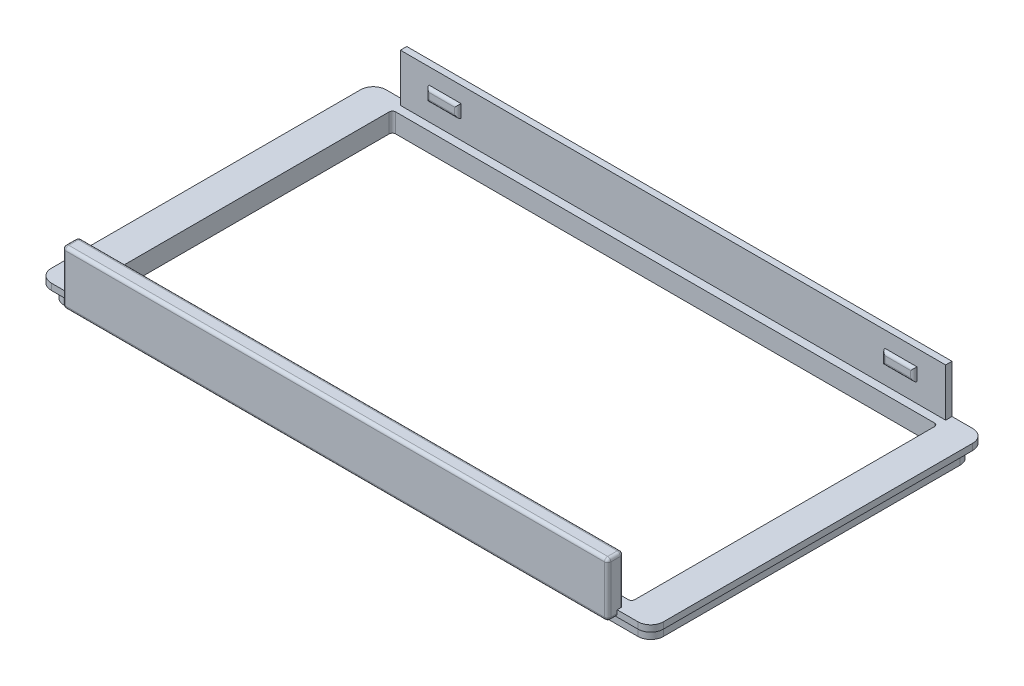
ISO-10303-21;
HEADER;
FILE_DESCRIPTION(('STEP AP214'),'2;1');
FILE_NAME('part.step','',(''),(''),'','','');
FILE_SCHEMA(('AUTOMOTIVE_DESIGN { 1 0 10303 214 1 1 1 1 }'));
ENDSEC;
DATA;
#1=APPLICATION_CONTEXT('core data for automotive mechanical design processes');
#2=APPLICATION_PROTOCOL_DEFINITION('international standard','automotive_design',2000,#1);
#3=PRODUCT_CONTEXT('',#1,'mechanical');
#4=PRODUCT('Part','Part','',(#3));
#5=PRODUCT_RELATED_PRODUCT_CATEGORY('part','',(#4));
#6=PRODUCT_DEFINITION_FORMATION('','',#4);
#7=PRODUCT_DEFINITION_CONTEXT('part definition',#1,'design');
#8=PRODUCT_DEFINITION('design','',#6,#7);
#9=PRODUCT_DEFINITION_SHAPE('','',#8);
#10=(LENGTH_UNIT() NAMED_UNIT(*) SI_UNIT(.MILLI.,.METRE.));
#11=(NAMED_UNIT(*) PLANE_ANGLE_UNIT() SI_UNIT($,.RADIAN.));
#12=(NAMED_UNIT(*) SI_UNIT($,.STERADIAN.) SOLID_ANGLE_UNIT());
#13=UNCERTAINTY_MEASURE_WITH_UNIT(LENGTH_MEASURE(1.E-05),#10,'distance_accuracy_value','');
#14=(GEOMETRIC_REPRESENTATION_CONTEXT(3) GLOBAL_UNCERTAINTY_ASSIGNED_CONTEXT((#13)) GLOBAL_UNIT_ASSIGNED_CONTEXT((#10,
#11,#12)) REPRESENTATION_CONTEXT('',''));
#15=CARTESIAN_POINT('',(0.,0.,0.));
#16=DIRECTION('',(0.,0.,1.));
#17=DIRECTION('',(1.,0.,0.));
#18=AXIS2_PLACEMENT_3D('',#15,#16,#17);
#19=CARTESIAN_POINT('',(0.,4.,-42.0023254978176));
#20=DIRECTION('',(0.,0.,1.));
#21=DIRECTION('',(1.,0.,0.));
#22=AXIS2_PLACEMENT_3D('',#19,#20,#21);
#23=PLANE('',#22);
#24=DIRECTION('',(1.,0.,0.));
#25=VECTOR('',#24,1.);
#26=CARTESIAN_POINT('',(0.,4.,-42.0023254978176));
#27=LINE('',#26,#25);
#28=CARTESIAN_POINT('',(48.5203620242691,4.,-42.0023254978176));
#29=VERTEX_POINT('',#28);
#30=CARTESIAN_POINT('',(56.0203620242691,4.,-42.0023254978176));
#31=VERTEX_POINT('',#30);
#32=EDGE_CURVE('E540',#29,#31,#27,.T.);
#33=ORIENTED_EDGE('',*,*,#32,.T.);
#34=CARTESIAN_POINT('',(56.0203620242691,5.,-42.0023254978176));
#35=DIRECTION('',(0.,0.,1.));
#36=DIRECTION('',(1.,0.,0.));
#37=AXIS2_PLACEMENT_3D('',#34,#35,#36);
#38=CIRCLE('',#37,1.);
#39=CARTESIAN_POINT('',(55.0203620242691,5.,-42.0023254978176));
#40=VERTEX_POINT('',#39);
#41=EDGE_CURVE('E11',#31,#40,#38,.F.);
#42=ORIENTED_EDGE('',*,*,#41,.T.);
#43=DIRECTION('',(0.,-1.,0.));
#44=VECTOR('',#43,1.);
#45=CARTESIAN_POINT('',(55.0203620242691,21.,-42.0023254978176));
#46=LINE('',#45,#44);
#47=CARTESIAN_POINT('',(55.0203620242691,6.,-42.0023254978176));
#48=VERTEX_POINT('',#47);
#49=EDGE_CURVE('E411',#48,#40,#46,.T.);
#50=ORIENTED_EDGE('',*,*,#49,.F.);
#51=DIRECTION('',(-1.,0.,0.));
#52=VECTOR('',#51,1.);
#53=CARTESIAN_POINT('',(0.,6.,-42.0023254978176));
#54=LINE('',#53,#52);
#55=CARTESIAN_POINT('',(48.5203620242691,6.,-42.0023254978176));
#56=VERTEX_POINT('',#55);
#57=EDGE_CURVE('E421',#48,#56,#54,.T.);
#58=ORIENTED_EDGE('',*,*,#57,.T.);
#59=DIRECTION('',(0.,1.,0.));
#60=VECTOR('',#59,1.);
#61=CARTESIAN_POINT('',(48.5203620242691,4.,-42.0023254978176));
#62=LINE('',#61,#60);
#63=EDGE_CURVE('E594',#56,#29,#62,.F.);
#64=ORIENTED_EDGE('',*,*,#63,.T.);
#65=EDGE_LOOP('',(#33,#42,#50,#58,#64));
#66=FACE_BOUND('',#65,.T.);
#67=ADVANCED_FACE('F41',(#66),#23,.T.);
#68=CARTESIAN_POINT('',(232.520362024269,6.,-42.0023254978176));
#69=VERTEX_POINT('',#68);
#70=CARTESIAN_POINT('',(226.020362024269,6.,-42.0023254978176));
#71=VERTEX_POINT('',#70);
#72=EDGE_CURVE('E430',#69,#71,#54,.T.);
#73=ORIENTED_EDGE('',*,*,#72,.T.);
#74=DIRECTION('',(0.,1.,0.));
#75=VECTOR('',#74,1.);
#76=CARTESIAN_POINT('',(226.020362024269,4.,-42.0023254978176));
#77=LINE('',#76,#75);
#78=CARTESIAN_POINT('',(226.020362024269,5.,-42.0023254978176));
#79=VERTEX_POINT('',#78);
#80=EDGE_CURVE('E432',#79,#71,#77,.T.);
#81=ORIENTED_EDGE('',*,*,#80,.F.);
#82=CARTESIAN_POINT('',(225.020362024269,5.,-42.0023254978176));
#83=DIRECTION('',(0.,0.,1.));
#84=DIRECTION('',(1.,0.,0.));
#85=AXIS2_PLACEMENT_3D('',#82,#83,#84);
#86=CIRCLE('',#85,1.);
#87=CARTESIAN_POINT('',(225.020362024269,4.,-42.0023254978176));
#88=VERTEX_POINT('',#87);
#89=EDGE_CURVE('E50',#79,#88,#86,.F.);
#90=ORIENTED_EDGE('',*,*,#89,.T.);
#91=CARTESIAN_POINT('',(232.520362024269,4.,-42.0023254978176));
#92=VERTEX_POINT('',#91);
#93=EDGE_CURVE('E539',#88,#92,#27,.T.);
#94=ORIENTED_EDGE('',*,*,#93,.T.);
#95=DIRECTION('',(0.,1.,0.));
#96=VECTOR('',#95,1.);
#97=CARTESIAN_POINT('',(232.520362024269,4.,-42.0023254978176));
#98=LINE('',#97,#96);
#99=EDGE_CURVE('E591',#92,#69,#98,.T.);
#100=ORIENTED_EDGE('',*,*,#99,.T.);
#101=EDGE_LOOP('',(#73,#81,#90,#94,#100));
#102=FACE_BOUND('',#101,.T.);
#103=ADVANCED_FACE('F895',(#102),#23,.T.);
#104=CARTESIAN_POINT('',(226.020362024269,6.,-44.0023254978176));
#105=DIRECTION('',(0.,0.,-1.));
#106=DIRECTION('',(-1.,0.,0.));
#107=AXIS2_PLACEMENT_3D('',#104,#105,#106);
#108=PLANE('',#107);
#109=DIRECTION('',(-1.,0.,0.));
#110=VECTOR('',#109,1.);
#111=CARTESIAN_POINT('',(226.020362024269,6.,-44.0023254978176));
#112=LINE('',#111,#110);
#113=CARTESIAN_POINT('',(225.020362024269,6.,-44.0023254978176));
#114=VERTEX_POINT('',#113);
#115=CARTESIAN_POINT('',(56.0203620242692,6.,-44.0023254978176));
#116=VERTEX_POINT('',#115);
#117=EDGE_CURVE('E417',#114,#116,#112,.T.);
#118=ORIENTED_EDGE('',*,*,#117,.T.);
#119=DIRECTION('',(0.,1.,0.));
#120=VECTOR('',#119,1.);
#121=CARTESIAN_POINT('',(56.0203620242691,6.,-44.0023254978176));
#122=LINE('',#121,#120);
#123=CARTESIAN_POINT('',(56.0203620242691,20.,-44.0023254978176));
#124=VERTEX_POINT('',#123);
#125=EDGE_CURVE('E63',#116,#124,#122,.T.);
#126=ORIENTED_EDGE('',*,*,#125,.T.);
#127=DIRECTION('',(-1.,0.,0.));
#128=VECTOR('',#127,1.);
#129=CARTESIAN_POINT('',(226.020362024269,20.,-44.0023254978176));
#130=LINE('',#129,#128);
#131=CARTESIAN_POINT('',(225.020362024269,20.,-44.0023254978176));
#132=VERTEX_POINT('',#131);
#133=EDGE_CURVE('E58',#124,#132,#130,.F.);
#134=ORIENTED_EDGE('',*,*,#133,.T.);
#135=DIRECTION('',(0.,1.,0.));
#136=VECTOR('',#135,1.);
#137=CARTESIAN_POINT('',(225.020362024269,6.,-44.0023254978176));
#138=LINE('',#137,#136);
#139=EDGE_CURVE('E801',#132,#114,#138,.F.);
#140=ORIENTED_EDGE('',*,*,#139,.T.);
#141=EDGE_LOOP('',(#118,#126,#134,#140));
#142=FACE_BOUND('',#141,.T.);
#143=DIRECTION('',(0.,-1.,0.));
#144=VECTOR('',#143,1.);
#145=CARTESIAN_POINT('',(64.0203620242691,0.,-44.0023254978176));
#146=LINE('',#145,#144);
#147=CARTESIAN_POINT('',(64.0203620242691,16.,-44.0023254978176));
#148=VERTEX_POINT('',#147);
#149=CARTESIAN_POINT('',(64.0203620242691,12.,-44.0023254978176));
#150=VERTEX_POINT('',#149);
#151=EDGE_CURVE('E473',#148,#150,#146,.T.);
#152=ORIENTED_EDGE('',*,*,#151,.T.);
#153=DIRECTION('',(1.,0.,0.));
#154=VECTOR('',#153,1.);
#155=CARTESIAN_POINT('',(0.,12.,-44.0023254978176));
#156=LINE('',#155,#154);
#157=CARTESIAN_POINT('',(74.0203620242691,12.,-44.0023254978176));
#158=VERTEX_POINT('',#157);
#159=EDGE_CURVE('E479',#150,#158,#156,.T.);
#160=ORIENTED_EDGE('',*,*,#159,.T.);
#161=DIRECTION('',(0.,1.,0.));
#162=VECTOR('',#161,1.);
#163=CARTESIAN_POINT('',(74.0203620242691,0.,-44.0023254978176));
#164=LINE('',#163,#162);
#165=CARTESIAN_POINT('',(74.0203620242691,16.,-44.0023254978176));
#166=VERTEX_POINT('',#165);
#167=EDGE_CURVE('E477',#158,#166,#164,.T.);
#168=ORIENTED_EDGE('',*,*,#167,.T.);
#169=DIRECTION('',(-1.,0.,0.));
#170=VECTOR('',#169,1.);
#171=CARTESIAN_POINT('',(0.,16.,-44.0023254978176));
#172=LINE('',#171,#170);
#173=EDGE_CURVE('E475',#166,#148,#172,.T.);
#174=ORIENTED_EDGE('',*,*,#173,.T.);
#175=EDGE_LOOP('',(#152,#160,#168,#174));
#176=FACE_BOUND('',#175,.T.);
#177=DIRECTION('',(-1.,0.,0.));
#178=VECTOR('',#177,1.);
#179=CARTESIAN_POINT('',(217.020362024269,12.,-44.0023254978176));
#180=LINE('',#179,#178);
#181=CARTESIAN_POINT('',(217.020362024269,12.,-44.0023254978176));
#182=VERTEX_POINT('',#181);
#183=CARTESIAN_POINT('',(207.020362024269,12.,-44.0023254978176));
#184=VERTEX_POINT('',#183);
#185=EDGE_CURVE('E467',#182,#184,#180,.T.);
#186=ORIENTED_EDGE('',*,*,#185,.F.);
#187=DIRECTION('',(0.,-1.,0.));
#188=VECTOR('',#187,1.);
#189=CARTESIAN_POINT('',(217.020362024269,16.,-44.0023254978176));
#190=LINE('',#189,#188);
#191=CARTESIAN_POINT('',(217.020362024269,16.,-44.0023254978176));
#192=VERTEX_POINT('',#191);
#193=EDGE_CURVE('E470',#192,#182,#190,.T.);
#194=ORIENTED_EDGE('',*,*,#193,.F.);
#195=DIRECTION('',(1.,0.,0.));
#196=VECTOR('',#195,1.);
#197=CARTESIAN_POINT('',(207.020362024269,16.,-44.0023254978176));
#198=LINE('',#197,#196);
#199=CARTESIAN_POINT('',(207.020362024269,16.,-44.0023254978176));
#200=VERTEX_POINT('',#199);
#201=EDGE_CURVE('E460',#200,#192,#198,.T.);
#202=ORIENTED_EDGE('',*,*,#201,.F.);
#203=DIRECTION('',(0.,1.,0.));
#204=VECTOR('',#203,1.);
#205=CARTESIAN_POINT('',(207.020362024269,12.,-44.0023254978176));
#206=LINE('',#205,#204);
#207=EDGE_CURVE('E463',#184,#200,#206,.T.);
#208=ORIENTED_EDGE('',*,*,#207,.F.);
#209=EDGE_LOOP('',(#186,#194,#202,#208));
#210=FACE_BOUND('',#209,.T.);
#211=ADVANCED_FACE('F868',(#142,#176,#210),#108,.T.);
#212=CARTESIAN_POINT('',(0.,21.,0.));
#213=DIRECTION('',(0.,-1.,0.));
#214=DIRECTION('',(0.,0.,-1.));
#215=AXIS2_PLACEMENT_3D('',#212,#213,#214);
#216=PLANE('',#215);
#217=DIRECTION('',(0.,0.,1.));
#218=VECTOR('',#217,1.);
#219=CARTESIAN_POINT('',(56.0203620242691,21.,-39.0023254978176));
#220=LINE('',#219,#218);
#221=CARTESIAN_POINT('',(56.0203620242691,21.,-43.0023254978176));
#222=VERTEX_POINT('',#221);
#223=CARTESIAN_POINT('',(56.0203620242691,21.,-40.0023254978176));
#224=VERTEX_POINT('',#223);
#225=EDGE_CURVE('E793',#222,#224,#220,.T.);
#226=ORIENTED_EDGE('',*,*,#225,.T.);
#227=DIRECTION('',(-1.,0.,0.));
#228=VECTOR('',#227,1.);
#229=CARTESIAN_POINT('',(226.020362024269,21.,-40.0023254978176));
#230=LINE('',#229,#228);
#231=CARTESIAN_POINT('',(225.020362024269,21.,-40.0023254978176));
#232=VERTEX_POINT('',#231);
#233=EDGE_CURVE('E797',#224,#232,#230,.F.);
#234=ORIENTED_EDGE('',*,*,#233,.T.);
#235=DIRECTION('',(0.,0.,1.));
#236=VECTOR('',#235,1.);
#237=CARTESIAN_POINT('',(225.020362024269,21.,0.));
#238=LINE('',#237,#236);
#239=CARTESIAN_POINT('',(225.020362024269,21.,-43.0023254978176));
#240=VERTEX_POINT('',#239);
#241=EDGE_CURVE('E795',#232,#240,#238,.F.);
#242=ORIENTED_EDGE('',*,*,#241,.T.);
#243=DIRECTION('',(-1.,0.,0.));
#244=VECTOR('',#243,1.);
#245=CARTESIAN_POINT('',(55.0203620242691,21.,-43.0023254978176));
#246=LINE('',#245,#244);
#247=EDGE_CURVE('E791',#240,#222,#246,.T.);
#248=ORIENTED_EDGE('',*,*,#247,.T.);
#249=EDGE_LOOP('',(#226,#234,#242,#248));
#250=FACE_BOUND('',#249,.T.);
#251=ADVANCED_FACE('F969',(#250),#216,.F.);
#252=CARTESIAN_POINT('',(236.520362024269,4.,0.));
#253=DIRECTION('',(1.,0.,0.));
#254=DIRECTION('',(0.,0.,-1.));
#255=AXIS2_PLACEMENT_3D('',#252,#253,#254);
#256=PLANE('',#255);
#257=DIRECTION('',(0.,0.,-1.));
#258=VECTOR('',#257,1.);
#259=CARTESIAN_POINT('',(236.520362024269,4.,0.));
#260=LINE('',#259,#258);
#261=CARTESIAN_POINT('',(236.520362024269,4.,-46.0023254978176));
#262=VERTEX_POINT('',#261);
#263=CARTESIAN_POINT('',(236.520362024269,4.,-143.002325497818));
#264=VERTEX_POINT('',#263);
#265=EDGE_CURVE('E542',#262,#264,#260,.T.);
#266=ORIENTED_EDGE('',*,*,#265,.T.);
#267=DIRECTION('',(0.,1.,0.));
#268=VECTOR('',#267,1.);
#269=CARTESIAN_POINT('',(236.520362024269,4.,-143.002325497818));
#270=LINE('',#269,#268);
#271=CARTESIAN_POINT('',(236.520362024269,6.,-143.002325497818));
#272=VERTEX_POINT('',#271);
#273=EDGE_CURVE('E635',#264,#272,#270,.T.);
#274=ORIENTED_EDGE('',*,*,#273,.T.);
#275=DIRECTION('',(0.,0.,1.));
#276=VECTOR('',#275,1.);
#277=CARTESIAN_POINT('',(236.520362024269,6.,0.));
#278=LINE('',#277,#276);
#279=CARTESIAN_POINT('',(236.520362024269,6.,-46.0023254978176));
#280=VERTEX_POINT('',#279);
#281=EDGE_CURVE('E517',#272,#280,#278,.T.);
#282=ORIENTED_EDGE('',*,*,#281,.T.);
#283=DIRECTION('',(0.,1.,0.));
#284=VECTOR('',#283,1.);
#285=CARTESIAN_POINT('',(236.520362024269,4.,-46.0023254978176));
#286=LINE('',#285,#284);
#287=EDGE_CURVE('E633',#280,#262,#286,.F.);
#288=ORIENTED_EDGE('',*,*,#287,.T.);
#289=EDGE_LOOP('',(#266,#274,#282,#288));
#290=FACE_BOUND('',#289,.T.);
#291=ADVANCED_FACE('F904',(#290),#256,.T.);
#292=CARTESIAN_POINT('',(44.5203620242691,4.,0.));
#293=DIRECTION('',(-1.,0.,0.));
#294=DIRECTION('',(0.,0.,1.));
#295=AXIS2_PLACEMENT_3D('',#292,#293,#294);
#296=PLANE('',#295);
#297=DIRECTION('',(0.,0.,1.));
#298=VECTOR('',#297,1.);
#299=CARTESIAN_POINT('',(44.5203620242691,4.,0.));
#300=LINE('',#299,#298);
#301=CARTESIAN_POINT('',(44.5203620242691,4.,-143.002325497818));
#302=VERTEX_POINT('',#301);
#303=CARTESIAN_POINT('',(44.5203620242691,4.,-46.0023254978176));
#304=VERTEX_POINT('',#303);
#305=EDGE_CURVE('E536',#302,#304,#300,.T.);
#306=ORIENTED_EDGE('',*,*,#305,.T.);
#307=DIRECTION('',(0.,1.,0.));
#308=VECTOR('',#307,1.);
#309=CARTESIAN_POINT('',(44.5203620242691,4.,-46.0023254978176));
#310=LINE('',#309,#308);
#311=CARTESIAN_POINT('',(44.5203620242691,6.,-46.0023254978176));
#312=VERTEX_POINT('',#311);
#313=EDGE_CURVE('E581',#304,#312,#310,.T.);
#314=ORIENTED_EDGE('',*,*,#313,.T.);
#315=DIRECTION('',(0.,0.,-1.));
#316=VECTOR('',#315,1.);
#317=CARTESIAN_POINT('',(44.5203620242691,6.,0.));
#318=LINE('',#317,#316);
#319=CARTESIAN_POINT('',(44.5203620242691,6.,-143.002325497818));
#320=VERTEX_POINT('',#319);
#321=EDGE_CURVE('E428',#312,#320,#318,.T.);
#322=ORIENTED_EDGE('',*,*,#321,.T.);
#323=DIRECTION('',(0.,1.,0.));
#324=VECTOR('',#323,1.);
#325=CARTESIAN_POINT('',(44.5203620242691,4.,-143.002325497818));
#326=LINE('',#325,#324);
#327=EDGE_CURVE('E579',#320,#302,#326,.F.);
#328=ORIENTED_EDGE('',*,*,#327,.T.);
#329=EDGE_LOOP('',(#306,#314,#322,#328));
#330=FACE_BOUND('',#329,.T.);
#331=ADVANCED_FACE('F940',(#330),#296,.T.);
#332=CARTESIAN_POINT('',(55.0203620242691,36.,0.));
#333=DIRECTION('',(1.,0.,0.));
#334=DIRECTION('',(0.,0.,-1.));
#335=AXIS2_PLACEMENT_3D('',#332,#333,#334);
#336=PLANE('',#335);
#337=DIRECTION('',(0.,0.,1.));
#338=VECTOR('',#337,1.);
#339=CARTESIAN_POINT('',(55.0203620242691,6.,0.));
#340=LINE('',#339,#338);
#341=CARTESIAN_POINT('',(55.0203620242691,6.,-141.502325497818));
#342=VERTEX_POINT('',#341);
#343=CARTESIAN_POINT('',(55.0203620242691,6.,-47.5023254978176));
#344=VERTEX_POINT('',#343);
#345=EDGE_CURVE('E510',#342,#344,#340,.T.);
#346=ORIENTED_EDGE('',*,*,#345,.T.);
#347=DIRECTION('',(0.,-1.,0.));
#348=VECTOR('',#347,1.);
#349=CARTESIAN_POINT('',(55.0203620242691,0.,-47.5023254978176));
#350=LINE('',#349,#348);
#351=CARTESIAN_POINT('',(55.0203620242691,0.,-47.5023254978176));
#352=VERTEX_POINT('',#351);
#353=EDGE_CURVE('E668',#344,#352,#350,.T.);
#354=ORIENTED_EDGE('',*,*,#353,.T.);
#355=DIRECTION('',(0.,0.,1.));
#356=VECTOR('',#355,1.);
#357=CARTESIAN_POINT('',(55.0203620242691,0.,0.));
#358=LINE('',#357,#356);
#359=CARTESIAN_POINT('',(55.0203620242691,0.,-141.502325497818));
#360=VERTEX_POINT('',#359);
#361=EDGE_CURVE('E520',#360,#352,#358,.T.);
#362=ORIENTED_EDGE('',*,*,#361,.F.);
#363=DIRECTION('',(0.,-1.,0.));
#364=VECTOR('',#363,1.);
#365=CARTESIAN_POINT('',(55.0203620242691,6.,-141.502325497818));
#366=LINE('',#365,#364);
#367=EDGE_CURVE('E666',#360,#342,#366,.F.);
#368=ORIENTED_EDGE('',*,*,#367,.T.);
#369=EDGE_LOOP('',(#346,#354,#362,#368));
#370=FACE_BOUND('',#369,.T.);
#371=ADVANCED_FACE('F991',(#370),#336,.T.);
#372=CARTESIAN_POINT('',(0.,36.,-46.5023254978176));
#373=DIRECTION('',(0.,0.,-1.));
#374=DIRECTION('',(-1.,0.,0.));
#375=AXIS2_PLACEMENT_3D('',#372,#373,#374);
#376=PLANE('',#375);
#377=DIRECTION('',(1.,0.,0.));
#378=VECTOR('',#377,1.);
#379=CARTESIAN_POINT('',(0.,6.,-46.5023254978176));
#380=LINE('',#379,#378);
#381=CARTESIAN_POINT('',(56.0203620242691,6.,-46.5023254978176));
#382=VERTEX_POINT('',#381);
#383=CARTESIAN_POINT('',(225.020362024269,6.,-46.5023254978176));
#384=VERTEX_POINT('',#383);
#385=EDGE_CURVE('E507',#382,#384,#380,.T.);
#386=ORIENTED_EDGE('',*,*,#385,.T.);
#387=DIRECTION('',(0.,-1.,0.));
#388=VECTOR('',#387,1.);
#389=CARTESIAN_POINT('',(225.020362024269,0.,-46.5023254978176));
#390=LINE('',#389,#388);
#391=CARTESIAN_POINT('',(225.020362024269,0.,-46.5023254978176));
#392=VERTEX_POINT('',#391);
#393=EDGE_CURVE('E663',#384,#392,#390,.T.);
#394=ORIENTED_EDGE('',*,*,#393,.T.);
#395=DIRECTION('',(1.,0.,0.));
#396=VECTOR('',#395,1.);
#397=CARTESIAN_POINT('',(0.,0.,-46.5023254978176));
#398=LINE('',#397,#396);
#399=CARTESIAN_POINT('',(56.0203620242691,0.,-46.5023254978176));
#400=VERTEX_POINT('',#399);
#401=EDGE_CURVE('E529',#400,#392,#398,.T.);
#402=ORIENTED_EDGE('',*,*,#401,.F.);
#403=DIRECTION('',(0.,-1.,0.));
#404=VECTOR('',#403,1.);
#405=CARTESIAN_POINT('',(56.0203620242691,6.,-46.5023254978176));
#406=LINE('',#405,#404);
#407=EDGE_CURVE('E661',#400,#382,#406,.F.);
#408=ORIENTED_EDGE('',*,*,#407,.T.);
#409=EDGE_LOOP('',(#386,#394,#402,#408));
#410=FACE_BOUND('',#409,.T.);
#411=ADVANCED_FACE('F1008',(#410),#376,.T.);
#412=CARTESIAN_POINT('',(226.020362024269,36.,0.));
#413=DIRECTION('',(-1.,0.,0.));
#414=DIRECTION('',(0.,0.,1.));
#415=AXIS2_PLACEMENT_3D('',#412,#413,#414);
#416=PLANE('',#415);
#417=DIRECTION('',(0.,0.,-1.));
#418=VECTOR('',#417,1.);
#419=CARTESIAN_POINT('',(226.020362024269,6.,0.));
#420=LINE('',#419,#418);
#421=CARTESIAN_POINT('',(226.020362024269,6.,-47.5023254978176));
#422=VERTEX_POINT('',#421);
#423=CARTESIAN_POINT('',(226.020362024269,6.,-141.502325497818));
#424=VERTEX_POINT('',#423);
#425=EDGE_CURVE('E502',#422,#424,#420,.T.);
#426=ORIENTED_EDGE('',*,*,#425,.T.);
#427=DIRECTION('',(0.,-1.,0.));
#428=VECTOR('',#427,1.);
#429=CARTESIAN_POINT('',(226.020362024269,0.,-141.502325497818));
#430=LINE('',#429,#428);
#431=CARTESIAN_POINT('',(226.020362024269,0.,-141.502325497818));
#432=VERTEX_POINT('',#431);
#433=EDGE_CURVE('E653',#424,#432,#430,.T.);
#434=ORIENTED_EDGE('',*,*,#433,.T.);
#435=DIRECTION('',(0.,0.,-1.));
#436=VECTOR('',#435,1.);
#437=CARTESIAN_POINT('',(226.020362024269,0.,0.));
#438=LINE('',#437,#436);
#439=CARTESIAN_POINT('',(226.020362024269,0.,-47.5023254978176));
#440=VERTEX_POINT('',#439);
#441=EDGE_CURVE('E526',#440,#432,#438,.T.);
#442=ORIENTED_EDGE('',*,*,#441,.F.);
#443=DIRECTION('',(0.,-1.,0.));
#444=VECTOR('',#443,1.);
#445=CARTESIAN_POINT('',(226.020362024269,6.,-47.5023254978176));
#446=LINE('',#445,#444);
#447=EDGE_CURVE('E651',#440,#422,#446,.F.);
#448=ORIENTED_EDGE('',*,*,#447,.T.);
#449=EDGE_LOOP('',(#426,#434,#442,#448));
#450=FACE_BOUND('',#449,.T.);
#451=ADVANCED_FACE('F1013',(#450),#416,.T.);
#452=CARTESIAN_POINT('',(0.,36.,-142.502325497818));
#453=DIRECTION('',(0.,0.,1.));
#454=DIRECTION('',(1.,0.,0.));
#455=AXIS2_PLACEMENT_3D('',#452,#453,#454);
#456=PLANE('',#455);
#457=DIRECTION('',(-1.,0.,0.));
#458=VECTOR('',#457,1.);
#459=CARTESIAN_POINT('',(0.,0.,-142.502325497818));
#460=LINE('',#459,#458);
#461=CARTESIAN_POINT('',(225.020362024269,0.,-142.502325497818));
#462=VERTEX_POINT('',#461);
#463=CARTESIAN_POINT('',(56.0203620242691,0.,-142.502325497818));
#464=VERTEX_POINT('',#463);
#465=EDGE_CURVE('E523',#462,#464,#460,.T.);
#466=ORIENTED_EDGE('',*,*,#465,.F.);
#467=DIRECTION('',(0.,-1.,0.));
#468=VECTOR('',#467,1.);
#469=CARTESIAN_POINT('',(225.020362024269,6.,-142.502325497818));
#470=LINE('',#469,#468);
#471=CARTESIAN_POINT('',(225.020362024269,6.,-142.502325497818));
#472=VERTEX_POINT('',#471);
#473=EDGE_CURVE('E659',#462,#472,#470,.F.);
#474=ORIENTED_EDGE('',*,*,#473,.T.);
#475=DIRECTION('',(-1.,0.,0.));
#476=VECTOR('',#475,1.);
#477=CARTESIAN_POINT('',(0.,6.,-142.502325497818));
#478=LINE('',#477,#476);
#479=CARTESIAN_POINT('',(56.0203620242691,6.,-142.502325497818));
#480=VERTEX_POINT('',#479);
#481=EDGE_CURVE('E571',#472,#480,#478,.T.);
#482=ORIENTED_EDGE('',*,*,#481,.T.);
#483=DIRECTION('',(0.,-1.,0.));
#484=VECTOR('',#483,1.);
#485=CARTESIAN_POINT('',(56.0203620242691,0.,-142.502325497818));
#486=LINE('',#485,#484);
#487=EDGE_CURVE('E656',#480,#464,#486,.T.);
#488=ORIENTED_EDGE('',*,*,#487,.T.);
#489=EDGE_LOOP('',(#466,#474,#482,#488));
#490=FACE_BOUND('',#489,.T.);
#491=ADVANCED_FACE('F1010',(#490),#456,.T.);
#492=CARTESIAN_POINT('',(0.,0.,0.));
#493=DIRECTION('',(0.,-1.,0.));
#494=DIRECTION('',(0.,0.,-1.));
#495=AXIS2_PLACEMENT_3D('',#492,#493,#494);
#496=PLANE('',#495);
#497=DIRECTION('',(1.,0.,0.));
#498=VECTOR('',#497,1.);
#499=CARTESIAN_POINT('',(234.520362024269,0.,-44.0023254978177));
#500=LINE('',#499,#498);
#501=CARTESIAN_POINT('',(50.5203620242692,0.,-44.0023254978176));
#502=VERTEX_POINT('',#501);
#503=CARTESIAN_POINT('',(230.520362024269,0.,-44.0023254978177));
#504=VERTEX_POINT('',#503);
#505=EDGE_CURVE('E556',#502,#504,#500,.T.);
#506=ORIENTED_EDGE('',*,*,#505,.F.);
#507=CARTESIAN_POINT('',(50.5203620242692,0.,-48.0023254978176));
#508=DIRECTION('',(0.,-1.,0.));
#509=DIRECTION('',(0.,0.,-1.));
#510=AXIS2_PLACEMENT_3D('',#507,#508,#509);
#511=CIRCLE('',#510,4.);
#512=CARTESIAN_POINT('',(46.5203620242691,0.,-48.0023254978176));
#513=VERTEX_POINT('',#512);
#514=EDGE_CURVE('E616',#502,#513,#511,.T.);
#515=ORIENTED_EDGE('',*,*,#514,.T.);
#516=DIRECTION('',(0.,0.,1.));
#517=VECTOR('',#516,1.);
#518=CARTESIAN_POINT('',(46.5203620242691,0.,-44.0023254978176));
#519=LINE('',#518,#517);
#520=CARTESIAN_POINT('',(46.5203620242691,0.,-141.002325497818));
#521=VERTEX_POINT('',#520);
#522=EDGE_CURVE('E565',#521,#513,#519,.T.);
#523=ORIENTED_EDGE('',*,*,#522,.F.);
#524=CARTESIAN_POINT('',(50.5203620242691,0.,-141.002325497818));
#525=DIRECTION('',(0.,-1.,0.));
#526=DIRECTION('',(0.,0.,-1.));
#527=AXIS2_PLACEMENT_3D('',#524,#525,#526);
#528=CIRCLE('',#527,4.);
#529=CARTESIAN_POINT('',(50.5203620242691,0.,-145.002325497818));
#530=VERTEX_POINT('',#529);
#531=EDGE_CURVE('E614',#521,#530,#528,.T.);
#532=ORIENTED_EDGE('',*,*,#531,.T.);
#533=DIRECTION('',(-1.,0.,0.));
#534=VECTOR('',#533,1.);
#535=CARTESIAN_POINT('',(46.5203620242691,0.,-145.002325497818));
#536=LINE('',#535,#534);
#537=CARTESIAN_POINT('',(230.520362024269,0.,-145.002325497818));
#538=VERTEX_POINT('',#537);
#539=EDGE_CURVE('E562',#538,#530,#536,.T.);
#540=ORIENTED_EDGE('',*,*,#539,.F.);
#541=CARTESIAN_POINT('',(230.520362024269,0.,-141.002325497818));
#542=DIRECTION('',(0.,-1.,0.));
#543=DIRECTION('',(0.,0.,-1.));
#544=AXIS2_PLACEMENT_3D('',#541,#542,#543);
#545=CIRCLE('',#544,4.);
#546=CARTESIAN_POINT('',(234.520362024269,0.,-141.002325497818));
#547=VERTEX_POINT('',#546);
#548=EDGE_CURVE('E610',#538,#547,#545,.T.);
#549=ORIENTED_EDGE('',*,*,#548,.T.);
#550=DIRECTION('',(0.,0.,-1.));
#551=VECTOR('',#550,1.);
#552=CARTESIAN_POINT('',(234.520362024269,0.,-145.002325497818));
#553=LINE('',#552,#551);
#554=CARTESIAN_POINT('',(234.520362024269,0.,-48.0023254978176));
#555=VERTEX_POINT('',#554);
#556=EDGE_CURVE('E559',#555,#547,#553,.T.);
#557=ORIENTED_EDGE('',*,*,#556,.F.);
#558=CARTESIAN_POINT('',(230.520362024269,0.,-48.0023254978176));
#559=DIRECTION('',(0.,-1.,0.));
#560=DIRECTION('',(0.,0.,-1.));
#561=AXIS2_PLACEMENT_3D('',#558,#559,#560);
#562=CIRCLE('',#561,4.);
#563=EDGE_CURVE('E612',#555,#504,#562,.T.);
#564=ORIENTED_EDGE('',*,*,#563,.T.);
#565=EDGE_LOOP('',(#506,#515,#523,#532,#540,#549,#557,#564));
#566=FACE_BOUND('',#565,.T.);
#567=ORIENTED_EDGE('',*,*,#441,.T.);
#568=CARTESIAN_POINT('',(225.020362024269,0.,-141.502325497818));
#569=DIRECTION('',(0.,-1.,0.));
#570=DIRECTION('',(0.,0.,-1.));
#571=AXIS2_PLACEMENT_3D('',#568,#569,#570);
#572=CIRCLE('',#571,1.);
#573=EDGE_CURVE('E671',#432,#462,#572,.F.);
#574=ORIENTED_EDGE('',*,*,#573,.T.);
#575=ORIENTED_EDGE('',*,*,#465,.T.);
#576=CARTESIAN_POINT('',(56.0203620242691,0.,-141.502325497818));
#577=DIRECTION('',(0.,-1.,0.));
#578=DIRECTION('',(0.,0.,-1.));
#579=AXIS2_PLACEMENT_3D('',#576,#577,#578);
#580=CIRCLE('',#579,1.);
#581=EDGE_CURVE('E683',#464,#360,#580,.F.);
#582=ORIENTED_EDGE('',*,*,#581,.T.);
#583=ORIENTED_EDGE('',*,*,#361,.T.);
#584=CARTESIAN_POINT('',(56.0203620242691,0.,-47.5023254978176));
#585=DIRECTION('',(0.,-1.,0.));
#586=DIRECTION('',(0.,0.,-1.));
#587=AXIS2_PLACEMENT_3D('',#584,#585,#586);
#588=CIRCLE('',#587,1.);
#589=EDGE_CURVE('E679',#352,#400,#588,.F.);
#590=ORIENTED_EDGE('',*,*,#589,.T.);
#591=ORIENTED_EDGE('',*,*,#401,.T.);
#592=CARTESIAN_POINT('',(225.020362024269,0.,-47.5023254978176));
#593=DIRECTION('',(0.,-1.,0.));
#594=DIRECTION('',(0.,0.,-1.));
#595=AXIS2_PLACEMENT_3D('',#592,#593,#594);
#596=CIRCLE('',#595,1.);
#597=EDGE_CURVE('E675',#392,#440,#596,.F.);
#598=ORIENTED_EDGE('',*,*,#597,.T.);
#599=EDGE_LOOP('',(#567,#574,#575,#582,#583,#590,#591,#598));
#600=FACE_BOUND('',#599,.T.);
#601=ADVANCED_FACE('F982',(#566,#600),#496,.T.);
#602=DIRECTION('',(-1.,0.,0.));
#603=VECTOR('',#602,1.);
#604=CARTESIAN_POINT('',(0.,21.,-147.002325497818));
#605=LINE('',#604,#603);
#606=CARTESIAN_POINT('',(226.020362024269,21.,-147.002325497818));
#607=VERTEX_POINT('',#606);
#608=CARTESIAN_POINT('',(55.0203620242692,21.,-147.002325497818));
#609=VERTEX_POINT('',#608);
#610=EDGE_CURVE('E532',#607,#609,#605,.T.);
#611=ORIENTED_EDGE('',*,*,#610,.T.);
#612=DIRECTION('',(0.,0.,-1.));
#613=VECTOR('',#612,1.);
#614=CARTESIAN_POINT('',(55.0203620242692,21.,-145.002325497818));
#615=LINE('',#614,#613);
#616=CARTESIAN_POINT('',(55.0203620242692,21.,-145.002325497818));
#617=VERTEX_POINT('',#616);
#618=EDGE_CURVE('E486',#617,#609,#615,.T.);
#619=ORIENTED_EDGE('',*,*,#618,.F.);
#620=DIRECTION('',(1.,0.,0.));
#621=VECTOR('',#620,1.);
#622=CARTESIAN_POINT('',(55.0203620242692,21.,-145.002325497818));
#623=LINE('',#622,#621);
#624=CARTESIAN_POINT('',(226.020362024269,21.,-145.002325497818));
#625=VERTEX_POINT('',#624);
#626=EDGE_CURVE('E496',#617,#625,#623,.T.);
#627=ORIENTED_EDGE('',*,*,#626,.T.);
#628=DIRECTION('',(0.,0.,1.));
#629=VECTOR('',#628,1.);
#630=CARTESIAN_POINT('',(226.020362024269,21.,-159.061216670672));
#631=LINE('',#630,#629);
#632=EDGE_CURVE('E482',#607,#625,#631,.T.);
#633=ORIENTED_EDGE('',*,*,#632,.F.);
#634=EDGE_LOOP('',(#611,#619,#627,#633));
#635=FACE_BOUND('',#634,.T.);
#636=ADVANCED_FACE('F926',(#635),#216,.F.);
#637=CARTESIAN_POINT('',(234.520362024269,21.,-44.0023254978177));
#638=DIRECTION('',(0.,0.,-1.));
#639=DIRECTION('',(-1.,0.,0.));
#640=AXIS2_PLACEMENT_3D('',#637,#638,#639);
#641=PLANE('',#640);
#642=DIRECTION('',(1.,0.,0.));
#643=VECTOR('',#642,1.);
#644=CARTESIAN_POINT('',(234.520362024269,4.,-44.0023254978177));
#645=LINE('',#644,#643);
#646=CARTESIAN_POINT('',(50.5203620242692,4.,-44.0023254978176));
#647=VERTEX_POINT('',#646);
#648=CARTESIAN_POINT('',(230.520362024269,4.,-44.0023254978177));
#649=VERTEX_POINT('',#648);
#650=EDGE_CURVE('E553',#647,#649,#645,.T.);
#651=ORIENTED_EDGE('',*,*,#650,.F.);
#652=DIRECTION('',(0.,-1.,0.));
#653=VECTOR('',#652,1.);
#654=CARTESIAN_POINT('',(50.5203620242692,21.,-44.0023254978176));
#655=LINE('',#654,#653);
#656=EDGE_CURVE('E607',#647,#502,#655,.T.);
#657=ORIENTED_EDGE('',*,*,#656,.T.);
#658=ORIENTED_EDGE('',*,*,#505,.T.);
#659=DIRECTION('',(0.,-1.,0.));
#660=VECTOR('',#659,1.);
#661=CARTESIAN_POINT('',(230.520362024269,21.,-44.0023254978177));
#662=LINE('',#661,#660);
#663=EDGE_CURVE('E605',#504,#649,#662,.F.);
#664=ORIENTED_EDGE('',*,*,#663,.T.);
#665=EDGE_LOOP('',(#651,#657,#658,#664));
#666=FACE_BOUND('',#665,.T.);
#667=ADVANCED_FACE('F981',(#666),#641,.F.);
#668=CARTESIAN_POINT('',(234.520362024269,21.,-145.002325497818));
#669=DIRECTION('',(-1.,0.,0.));
#670=DIRECTION('',(0.,0.,1.));
#671=AXIS2_PLACEMENT_3D('',#668,#669,#670);
#672=PLANE('',#671);
#673=DIRECTION('',(0.,0.,-1.));
#674=VECTOR('',#673,1.);
#675=CARTESIAN_POINT('',(234.520362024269,4.,-145.002325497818));
#676=LINE('',#675,#674);
#677=CARTESIAN_POINT('',(234.520362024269,4.,-48.0023254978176));
#678=VERTEX_POINT('',#677);
#679=CARTESIAN_POINT('',(234.520362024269,4.,-141.002325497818));
#680=VERTEX_POINT('',#679);
#681=EDGE_CURVE('E550',#678,#680,#676,.T.);
#682=ORIENTED_EDGE('',*,*,#681,.F.);
#683=DIRECTION('',(0.,-1.,0.));
#684=VECTOR('',#683,1.);
#685=CARTESIAN_POINT('',(234.520362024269,21.,-48.0023254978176));
#686=LINE('',#685,#684);
#687=EDGE_CURVE('E640',#678,#555,#686,.T.);
#688=ORIENTED_EDGE('',*,*,#687,.T.);
#689=ORIENTED_EDGE('',*,*,#556,.T.);
#690=DIRECTION('',(0.,-1.,0.));
#691=VECTOR('',#690,1.);
#692=CARTESIAN_POINT('',(234.520362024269,21.,-141.002325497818));
#693=LINE('',#692,#691);
#694=EDGE_CURVE('E638',#547,#680,#693,.F.);
#695=ORIENTED_EDGE('',*,*,#694,.T.);
#696=EDGE_LOOP('',(#682,#688,#689,#695));
#697=FACE_BOUND('',#696,.T.);
#698=ADVANCED_FACE('F1560',(#697),#672,.F.);
#699=CARTESIAN_POINT('',(46.5203620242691,21.,-145.002325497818));
#700=DIRECTION('',(0.,0.,1.));
#701=DIRECTION('',(1.,0.,0.));
#702=AXIS2_PLACEMENT_3D('',#699,#700,#701);
#703=PLANE('',#702);
#704=ORIENTED_EDGE('',*,*,#539,.T.);
#705=DIRECTION('',(0.,-1.,0.));
#706=VECTOR('',#705,1.);
#707=CARTESIAN_POINT('',(50.5203620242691,21.,-145.002325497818));
#708=LINE('',#707,#706);
#709=CARTESIAN_POINT('',(50.5203620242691,4.,-145.002325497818));
#710=VERTEX_POINT('',#709);
#711=EDGE_CURVE('E631',#530,#710,#708,.F.);
#712=ORIENTED_EDGE('',*,*,#711,.T.);
#713=DIRECTION('',(-1.,0.,0.));
#714=VECTOR('',#713,1.);
#715=CARTESIAN_POINT('',(46.5203620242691,4.,-145.002325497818));
#716=LINE('',#715,#714);
#717=CARTESIAN_POINT('',(230.520362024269,4.,-145.002325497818));
#718=VERTEX_POINT('',#717);
#719=EDGE_CURVE('E545',#718,#710,#716,.T.);
#720=ORIENTED_EDGE('',*,*,#719,.F.);
#721=DIRECTION('',(0.,-1.,0.));
#722=VECTOR('',#721,1.);
#723=CARTESIAN_POINT('',(230.520362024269,21.,-145.002325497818));
#724=LINE('',#723,#722);
#725=EDGE_CURVE('E628',#718,#538,#724,.T.);
#726=ORIENTED_EDGE('',*,*,#725,.T.);
#727=EDGE_LOOP('',(#704,#712,#720,#726));
#728=FACE_BOUND('',#727,.T.);
#729=ADVANCED_FACE('F1002',(#728),#703,.F.);
#730=CARTESIAN_POINT('',(46.5203620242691,21.,-44.0023254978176));
#731=DIRECTION('',(1.,0.,0.));
#732=DIRECTION('',(0.,0.,-1.));
#733=AXIS2_PLACEMENT_3D('',#730,#731,#732);
#734=PLANE('',#733);
#735=ORIENTED_EDGE('',*,*,#522,.T.);
#736=DIRECTION('',(0.,-1.,0.));
#737=VECTOR('',#736,1.);
#738=CARTESIAN_POINT('',(46.5203620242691,21.,-48.0023254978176));
#739=LINE('',#738,#737);
#740=CARTESIAN_POINT('',(46.5203620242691,4.,-48.0023254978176));
#741=VERTEX_POINT('',#740);
#742=EDGE_CURVE('E621',#513,#741,#739,.F.);
#743=ORIENTED_EDGE('',*,*,#742,.T.);
#744=DIRECTION('',(0.,0.,1.));
#745=VECTOR('',#744,1.);
#746=CARTESIAN_POINT('',(46.5203620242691,4.,-44.0023254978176));
#747=LINE('',#746,#745);
#748=CARTESIAN_POINT('',(46.5203620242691,4.,-141.002325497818));
#749=VERTEX_POINT('',#748);
#750=EDGE_CURVE('E568',#749,#741,#747,.T.);
#751=ORIENTED_EDGE('',*,*,#750,.F.);
#752=DIRECTION('',(0.,-1.,0.));
#753=VECTOR('',#752,1.);
#754=CARTESIAN_POINT('',(46.5203620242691,21.,-141.002325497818));
#755=LINE('',#754,#753);
#756=EDGE_CURVE('E618',#749,#521,#755,.T.);
#757=ORIENTED_EDGE('',*,*,#756,.T.);
#758=EDGE_LOOP('',(#735,#743,#751,#757));
#759=FACE_BOUND('',#758,.T.);
#760=ADVANCED_FACE('F998',(#759),#734,.F.);
#761=CARTESIAN_POINT('',(0.,4.,0.));
#762=DIRECTION('',(0.,1.,0.));
#763=DIRECTION('',(0.,0.,1.));
#764=AXIS2_PLACEMENT_3D('',#761,#762,#763);
#765=PLANE('',#764);
#766=ORIENTED_EDGE('',*,*,#93,.F.);
#767=DIRECTION('',(0.,0.,-1.));
#768=VECTOR('',#767,1.);
#769=CARTESIAN_POINT('',(225.020362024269,4.,0.));
#770=LINE('',#769,#768);
#771=CARTESIAN_POINT('',(225.020362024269,4.,-40.0023254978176));
#772=VERTEX_POINT('',#771);
#773=EDGE_CURVE('E782',#88,#772,#770,.F.);
#774=ORIENTED_EDGE('',*,*,#773,.T.);
#775=DIRECTION('',(1.,0.,0.));
#776=VECTOR('',#775,1.);
#777=CARTESIAN_POINT('',(55.0203620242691,4.,-40.0023254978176));
#778=LINE('',#777,#776);
#779=CARTESIAN_POINT('',(56.0203620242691,4.,-40.0023254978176));
#780=VERTEX_POINT('',#779);
#781=EDGE_CURVE('E780',#772,#780,#778,.F.);
#782=ORIENTED_EDGE('',*,*,#781,.T.);
#783=DIRECTION('',(0.,0.,-1.));
#784=VECTOR('',#783,1.);
#785=CARTESIAN_POINT('',(56.0203620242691,4.,-42.0023254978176));
#786=LINE('',#785,#784);
#787=EDGE_CURVE('E777',#780,#31,#786,.T.);
#788=ORIENTED_EDGE('',*,*,#787,.T.);
#789=ORIENTED_EDGE('',*,*,#32,.F.);
#790=CARTESIAN_POINT('',(48.5203620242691,4.,-46.0023254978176));
#791=DIRECTION('',(0.,1.,0.));
#792=DIRECTION('',(0.,0.,1.));
#793=AXIS2_PLACEMENT_3D('',#790,#791,#792);
#794=CIRCLE('',#793,4.);
#795=EDGE_CURVE('E603',#29,#304,#794,.F.);
#796=ORIENTED_EDGE('',*,*,#795,.T.);
#797=ORIENTED_EDGE('',*,*,#305,.F.);
#798=CARTESIAN_POINT('',(48.5203620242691,4.,-143.002325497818));
#799=DIRECTION('',(0.,1.,0.));
#800=DIRECTION('',(0.,0.,1.));
#801=AXIS2_PLACEMENT_3D('',#798,#799,#800);
#802=CIRCLE('',#801,4.);
#803=CARTESIAN_POINT('',(48.5203620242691,4.,-147.002325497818));
#804=VERTEX_POINT('',#803);
#805=EDGE_CURVE('E601',#302,#804,#802,.F.);
#806=ORIENTED_EDGE('',*,*,#805,.T.);
#807=DIRECTION('',(-1.,0.,0.));
#808=VECTOR('',#807,1.);
#809=CARTESIAN_POINT('',(0.,4.,-147.002325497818));
#810=LINE('',#809,#808);
#811=CARTESIAN_POINT('',(232.520362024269,4.,-147.002325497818));
#812=VERTEX_POINT('',#811);
#813=EDGE_CURVE('E533',#812,#804,#810,.T.);
#814=ORIENTED_EDGE('',*,*,#813,.F.);
#815=CARTESIAN_POINT('',(232.520362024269,4.,-143.002325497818));
#816=DIRECTION('',(0.,1.,0.));
#817=DIRECTION('',(0.,0.,1.));
#818=AXIS2_PLACEMENT_3D('',#815,#816,#817);
#819=CIRCLE('',#818,4.);
#820=EDGE_CURVE('E599',#812,#264,#819,.F.);
#821=ORIENTED_EDGE('',*,*,#820,.T.);
#822=ORIENTED_EDGE('',*,*,#265,.F.);
#823=CARTESIAN_POINT('',(232.520362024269,4.,-46.0023254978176));
#824=DIRECTION('',(0.,1.,0.));
#825=DIRECTION('',(0.,0.,1.));
#826=AXIS2_PLACEMENT_3D('',#823,#824,#825);
#827=CIRCLE('',#826,4.);
#828=EDGE_CURVE('E596',#262,#92,#827,.F.);
#829=ORIENTED_EDGE('',*,*,#828,.T.);
#830=EDGE_LOOP('',(#766,#774,#782,#788,#789,#796,#797,#806,#814,#821,#822,#829));
#831=FACE_BOUND('',#830,.T.);
#832=ORIENTED_EDGE('',*,*,#719,.T.);
#833=CARTESIAN_POINT('',(50.5203620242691,4.,-141.002325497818));
#834=DIRECTION('',(0.,1.,0.));
#835=DIRECTION('',(0.,0.,1.));
#836=AXIS2_PLACEMENT_3D('',#833,#834,#835);
#837=CIRCLE('',#836,4.);
#838=EDGE_CURVE('E645',#710,#749,#837,.T.);
#839=ORIENTED_EDGE('',*,*,#838,.T.);
#840=ORIENTED_EDGE('',*,*,#750,.T.);
#841=CARTESIAN_POINT('',(50.5203620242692,4.,-48.0023254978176));
#842=DIRECTION('',(0.,1.,0.));
#843=DIRECTION('',(0.,0.,1.));
#844=AXIS2_PLACEMENT_3D('',#841,#842,#843);
#845=CIRCLE('',#844,4.);
#846=EDGE_CURVE('E643',#741,#647,#845,.T.);
#847=ORIENTED_EDGE('',*,*,#846,.T.);
#848=ORIENTED_EDGE('',*,*,#650,.T.);
#849=CARTESIAN_POINT('',(230.520362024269,4.,-48.0023254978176));
#850=DIRECTION('',(0.,1.,0.));
#851=DIRECTION('',(0.,0.,1.));
#852=AXIS2_PLACEMENT_3D('',#849,#850,#851);
#853=CIRCLE('',#852,4.);
#854=EDGE_CURVE('E647',#649,#678,#853,.T.);
#855=ORIENTED_EDGE('',*,*,#854,.T.);
#856=ORIENTED_EDGE('',*,*,#681,.T.);
#857=CARTESIAN_POINT('',(230.520362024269,4.,-141.002325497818));
#858=DIRECTION('',(0.,1.,0.));
#859=DIRECTION('',(0.,0.,1.));
#860=AXIS2_PLACEMENT_3D('',#857,#858,#859);
#861=CIRCLE('',#860,4.);
#862=EDGE_CURVE('E649',#680,#718,#861,.T.);
#863=ORIENTED_EDGE('',*,*,#862,.T.);
#864=EDGE_LOOP('',(#832,#839,#840,#847,#848,#855,#856,#863));
#865=FACE_BOUND('',#864,.T.);
#866=ADVANCED_FACE('F907',(#831,#865),#765,.F.);
#867=CARTESIAN_POINT('',(0.,4.,-147.002325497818));
#868=DIRECTION('',(0.,0.,-1.));
#869=DIRECTION('',(-1.,0.,0.));
#870=AXIS2_PLACEMENT_3D('',#867,#868,#869);
#871=PLANE('',#870);
#872=ORIENTED_EDGE('',*,*,#813,.T.);
#873=DIRECTION('',(0.,1.,0.));
#874=VECTOR('',#873,1.);
#875=CARTESIAN_POINT('',(48.5203620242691,4.,-147.002325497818));
#876=LINE('',#875,#874);
#877=CARTESIAN_POINT('',(48.5203620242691,6.,-147.002325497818));
#878=VERTEX_POINT('',#877);
#879=EDGE_CURVE('E625',#804,#878,#876,.T.);
#880=ORIENTED_EDGE('',*,*,#879,.T.);
#881=DIRECTION('',(1.,0.,0.));
#882=VECTOR('',#881,1.);
#883=CARTESIAN_POINT('',(0.,6.,-147.002325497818));
#884=LINE('',#883,#882);
#885=CARTESIAN_POINT('',(55.0203620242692,6.,-147.002325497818));
#886=VERTEX_POINT('',#885);
#887=EDGE_CURVE('E427',#878,#886,#884,.T.);
#888=ORIENTED_EDGE('',*,*,#887,.T.);
#889=DIRECTION('',(0.,-1.,0.));
#890=VECTOR('',#889,1.);
#891=CARTESIAN_POINT('',(55.0203620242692,4.,-147.002325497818));
#892=LINE('',#891,#890);
#893=EDGE_CURVE('E576',#609,#886,#892,.T.);
#894=ORIENTED_EDGE('',*,*,#893,.F.);
#895=ORIENTED_EDGE('',*,*,#610,.F.);
#896=DIRECTION('',(0.,1.,0.));
#897=VECTOR('',#896,1.);
#898=CARTESIAN_POINT('',(226.020362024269,4.,-147.002325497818));
#899=LINE('',#898,#897);
#900=CARTESIAN_POINT('',(226.020362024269,6.,-147.002325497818));
#901=VERTEX_POINT('',#900);
#902=EDGE_CURVE('E574',#901,#607,#899,.T.);
#903=ORIENTED_EDGE('',*,*,#902,.F.);
#904=CARTESIAN_POINT('',(232.520362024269,6.,-147.002325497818));
#905=VERTEX_POINT('',#904);
#906=EDGE_CURVE('E516',#901,#905,#884,.T.);
#907=ORIENTED_EDGE('',*,*,#906,.T.);
#908=DIRECTION('',(0.,1.,0.));
#909=VECTOR('',#908,1.);
#910=CARTESIAN_POINT('',(232.520362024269,4.,-147.002325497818));
#911=LINE('',#910,#909);
#912=EDGE_CURVE('E623',#905,#812,#911,.F.);
#913=ORIENTED_EDGE('',*,*,#912,.T.);
#914=EDGE_LOOP('',(#872,#880,#888,#894,#895,#903,#907,#913));
#915=FACE_BOUND('',#914,.T.);
#916=ADVANCED_FACE('F918',(#915),#871,.T.);
#917=CARTESIAN_POINT('',(226.020362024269,6.,-44.0023254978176));
#918=DIRECTION('',(-1.,0.,0.));
#919=DIRECTION('',(0.,0.,1.));
#920=AXIS2_PLACEMENT_3D('',#917,#918,#919);
#921=PLANE('',#920);
#922=DIRECTION('',(0.,0.,1.));
#923=VECTOR('',#922,1.);
#924=CARTESIAN_POINT('',(226.020362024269,6.,-44.0023254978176));
#925=LINE('',#924,#923);
#926=CARTESIAN_POINT('',(226.020362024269,6.,-43.0023254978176));
#927=VERTEX_POINT('',#926);
#928=EDGE_CURVE('E483',#927,#71,#925,.T.);
#929=ORIENTED_EDGE('',*,*,#928,.F.);
#930=DIRECTION('',(0.,1.,0.));
#931=VECTOR('',#930,1.);
#932=CARTESIAN_POINT('',(226.020362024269,21.,-43.0023254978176));
#933=LINE('',#932,#931);
#934=CARTESIAN_POINT('',(226.020362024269,20.,-43.0023254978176));
#935=VERTEX_POINT('',#934);
#936=EDGE_CURVE('E775',#927,#935,#933,.T.);
#937=ORIENTED_EDGE('',*,*,#936,.T.);
#938=DIRECTION('',(0.,0.,1.));
#939=VECTOR('',#938,1.);
#940=CARTESIAN_POINT('',(226.020362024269,20.,-44.0023254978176));
#941=LINE('',#940,#939);
#942=CARTESIAN_POINT('',(226.020362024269,20.,-40.0023254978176));
#943=VERTEX_POINT('',#942);
#944=EDGE_CURVE('E773',#935,#943,#941,.T.);
#945=ORIENTED_EDGE('',*,*,#944,.T.);
#946=DIRECTION('',(0.,1.,0.));
#947=VECTOR('',#946,1.);
#948=CARTESIAN_POINT('',(226.020362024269,4.,-40.0023254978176));
#949=LINE('',#948,#947);
#950=CARTESIAN_POINT('',(226.020362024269,5.,-40.0023254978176));
#951=VERTEX_POINT('',#950);
#952=EDGE_CURVE('E770',#943,#951,#949,.F.);
#953=ORIENTED_EDGE('',*,*,#952,.T.);
#954=DIRECTION('',(0.,0.,-1.));
#955=VECTOR('',#954,1.);
#956=CARTESIAN_POINT('',(226.020362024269,5.,-44.0023254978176));
#957=LINE('',#956,#955);
#958=EDGE_CURVE('E768',#951,#79,#957,.T.);
#959=ORIENTED_EDGE('',*,*,#958,.T.);
#960=ORIENTED_EDGE('',*,*,#80,.T.);
#961=EDGE_LOOP('',(#929,#937,#945,#953,#959,#960));
#962=FACE_BOUND('',#961,.T.);
#963=ADVANCED_FACE('F889',(#962),#921,.F.);
#964=CARTESIAN_POINT('',(55.0203620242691,6.,-44.0023254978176));
#965=DIRECTION('',(-1.,0.,0.));
#966=DIRECTION('',(0.,0.,1.));
#967=AXIS2_PLACEMENT_3D('',#964,#965,#966);
#968=PLANE('',#967);
#969=DIRECTION('',(0.,0.,1.));
#970=VECTOR('',#969,1.);
#971=CARTESIAN_POINT('',(55.0203620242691,20.,-44.0023254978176));
#972=LINE('',#971,#970);
#973=CARTESIAN_POINT('',(55.0203620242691,20.,-40.0023254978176));
#974=VERTEX_POINT('',#973);
#975=CARTESIAN_POINT('',(55.0203620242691,20.,-43.0023254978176));
#976=VERTEX_POINT('',#975);
#977=EDGE_CURVE('E788',#974,#976,#972,.F.);
#978=ORIENTED_EDGE('',*,*,#977,.T.);
#979=DIRECTION('',(0.,1.,0.));
#980=VECTOR('',#979,1.);
#981=CARTESIAN_POINT('',(55.0203620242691,6.,-43.0023254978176));
#982=LINE('',#981,#980);
#983=CARTESIAN_POINT('',(55.0203620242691,6.,-43.0023254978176));
#984=VERTEX_POINT('',#983);
#985=EDGE_CURVE('E414',#976,#984,#982,.F.);
#986=ORIENTED_EDGE('',*,*,#985,.T.);
#987=DIRECTION('',(0.,0.,1.));
#988=VECTOR('',#987,1.);
#989=CARTESIAN_POINT('',(55.0203620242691,6.,-44.0023254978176));
#990=LINE('',#989,#988);
#991=EDGE_CURVE('E407',#984,#48,#990,.T.);
#992=ORIENTED_EDGE('',*,*,#991,.T.);
#993=ORIENTED_EDGE('',*,*,#49,.T.);
#994=DIRECTION('',(0.,0.,-1.));
#995=VECTOR('',#994,1.);
#996=CARTESIAN_POINT('',(55.0203620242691,5.,-39.0023254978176));
#997=LINE('',#996,#995);
#998=CARTESIAN_POINT('',(55.0203620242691,5.,-40.0023254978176));
#999=VERTEX_POINT('',#998);
#1000=EDGE_CURVE('E784',#40,#999,#997,.F.);
#1001=ORIENTED_EDGE('',*,*,#1000,.T.);
#1002=DIRECTION('',(0.,-1.,0.));
#1003=VECTOR('',#1002,1.);
#1004=CARTESIAN_POINT('',(55.0203620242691,6.,-40.0023254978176));
#1005=LINE('',#1004,#1003);
#1006=EDGE_CURVE('E786',#999,#974,#1005,.F.);
#1007=ORIENTED_EDGE('',*,*,#1006,.T.);
#1008=EDGE_LOOP('',(#978,#986,#992,#993,#1001,#1007));
#1009=FACE_BOUND('',#1008,.T.);
#1010=ADVANCED_FACE('F409',(#1009),#968,.T.);
#1011=CARTESIAN_POINT('',(55.0203620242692,6.,-145.002325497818));
#1012=DIRECTION('',(1.,0.,0.));
#1013=DIRECTION('',(0.,0.,-1.));
#1014=AXIS2_PLACEMENT_3D('',#1011,#1012,#1013);
#1015=PLANE('',#1014);
#1016=ORIENTED_EDGE('',*,*,#893,.T.);
#1017=DIRECTION('',(0.,0.,-1.));
#1018=VECTOR('',#1017,1.);
#1019=CARTESIAN_POINT('',(55.0203620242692,6.,-145.002325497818));
#1020=LINE('',#1019,#1018);
#1021=CARTESIAN_POINT('',(55.0203620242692,6.,-145.002325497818));
#1022=VERTEX_POINT('',#1021);
#1023=EDGE_CURVE('E418',#1022,#886,#1020,.T.);
#1024=ORIENTED_EDGE('',*,*,#1023,.F.);
#1025=DIRECTION('',(0.,1.,0.));
#1026=VECTOR('',#1025,1.);
#1027=CARTESIAN_POINT('',(55.0203620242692,6.,-145.002325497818));
#1028=LINE('',#1027,#1026);
#1029=EDGE_CURVE('E500',#1022,#617,#1028,.T.);
#1030=ORIENTED_EDGE('',*,*,#1029,.T.);
#1031=ORIENTED_EDGE('',*,*,#618,.T.);
#1032=EDGE_LOOP('',(#1016,#1024,#1030,#1031));
#1033=FACE_BOUND('',#1032,.T.);
#1034=ADVANCED_FACE('F935',(#1033),#1015,.F.);
#1035=CARTESIAN_POINT('',(55.0203620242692,6.,-145.002325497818));
#1036=DIRECTION('',(0.,0.,1.));
#1037=DIRECTION('',(1.,0.,0.));
#1038=AXIS2_PLACEMENT_3D('',#1035,#1036,#1037);
#1039=PLANE('',#1038);
#1040=DIRECTION('',(-1.,0.,0.));
#1041=VECTOR('',#1040,1.);
#1042=CARTESIAN_POINT('',(74.0203620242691,12.,-145.002325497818));
#1043=LINE('',#1042,#1041);
#1044=CARTESIAN_POINT('',(74.0203620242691,12.,-145.002325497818));
#1045=VERTEX_POINT('',#1044);
#1046=CARTESIAN_POINT('',(64.0203620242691,12.,-145.002325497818));
#1047=VERTEX_POINT('',#1046);
#1048=EDGE_CURVE('E448',#1045,#1047,#1043,.T.);
#1049=ORIENTED_EDGE('',*,*,#1048,.T.);
#1050=DIRECTION('',(0.,1.,0.));
#1051=VECTOR('',#1050,1.);
#1052=CARTESIAN_POINT('',(64.0203620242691,12.,-145.002325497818));
#1053=LINE('',#1052,#1051);
#1054=CARTESIAN_POINT('',(64.0203620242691,16.,-145.002325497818));
#1055=VERTEX_POINT('',#1054);
#1056=EDGE_CURVE('E445',#1047,#1055,#1053,.T.);
#1057=ORIENTED_EDGE('',*,*,#1056,.T.);
#1058=DIRECTION('',(1.,0.,0.));
#1059=VECTOR('',#1058,1.);
#1060=CARTESIAN_POINT('',(64.0203620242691,16.,-145.002325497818));
#1061=LINE('',#1060,#1059);
#1062=CARTESIAN_POINT('',(74.0203620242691,16.,-145.002325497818));
#1063=VERTEX_POINT('',#1062);
#1064=EDGE_CURVE('E442',#1055,#1063,#1061,.T.);
#1065=ORIENTED_EDGE('',*,*,#1064,.T.);
#1066=DIRECTION('',(0.,-1.,0.));
#1067=VECTOR('',#1066,1.);
#1068=CARTESIAN_POINT('',(74.0203620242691,16.,-145.002325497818));
#1069=LINE('',#1068,#1067);
#1070=EDGE_CURVE('E440',#1063,#1045,#1069,.T.);
#1071=ORIENTED_EDGE('',*,*,#1070,.T.);
#1072=EDGE_LOOP('',(#1049,#1057,#1065,#1071));
#1073=FACE_BOUND('',#1072,.T.);
#1074=DIRECTION('',(0.,-1.,0.));
#1075=VECTOR('',#1074,1.);
#1076=CARTESIAN_POINT('',(217.020362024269,0.,-145.002325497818));
#1077=LINE('',#1076,#1075);
#1078=CARTESIAN_POINT('',(217.020362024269,16.,-145.002325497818));
#1079=VERTEX_POINT('',#1078);
#1080=CARTESIAN_POINT('',(217.020362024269,12.,-145.002325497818));
#1081=VERTEX_POINT('',#1080);
#1082=EDGE_CURVE('E450',#1079,#1081,#1077,.T.);
#1083=ORIENTED_EDGE('',*,*,#1082,.T.);
#1084=DIRECTION('',(-1.,0.,0.));
#1085=VECTOR('',#1084,1.);
#1086=CARTESIAN_POINT('',(0.,12.,-145.002325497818));
#1087=LINE('',#1086,#1085);
#1088=CARTESIAN_POINT('',(207.020362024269,12.,-145.002325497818));
#1089=VERTEX_POINT('',#1088);
#1090=EDGE_CURVE('E456',#1081,#1089,#1087,.T.);
#1091=ORIENTED_EDGE('',*,*,#1090,.T.);
#1092=DIRECTION('',(0.,1.,0.));
#1093=VECTOR('',#1092,1.);
#1094=CARTESIAN_POINT('',(207.020362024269,0.,-145.002325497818));
#1095=LINE('',#1094,#1093);
#1096=CARTESIAN_POINT('',(207.020362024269,16.,-145.002325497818));
#1097=VERTEX_POINT('',#1096);
#1098=EDGE_CURVE('E454',#1089,#1097,#1095,.T.);
#1099=ORIENTED_EDGE('',*,*,#1098,.T.);
#1100=DIRECTION('',(1.,0.,0.));
#1101=VECTOR('',#1100,1.);
#1102=CARTESIAN_POINT('',(0.,16.,-145.002325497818));
#1103=LINE('',#1102,#1101);
#1104=EDGE_CURVE('E452',#1097,#1079,#1103,.T.);
#1105=ORIENTED_EDGE('',*,*,#1104,.T.);
#1106=EDGE_LOOP('',(#1083,#1091,#1099,#1105));
#1107=FACE_BOUND('',#1106,.T.);
#1108=ORIENTED_EDGE('',*,*,#626,.F.);
#1109=ORIENTED_EDGE('',*,*,#1029,.F.);
#1110=DIRECTION('',(1.,0.,0.));
#1111=VECTOR('',#1110,1.);
#1112=CARTESIAN_POINT('',(55.0203620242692,6.,-145.002325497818));
#1113=LINE('',#1112,#1111);
#1114=CARTESIAN_POINT('',(226.020362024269,6.,-145.002325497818));
#1115=VERTEX_POINT('',#1114);
#1116=EDGE_CURVE('E488',#1022,#1115,#1113,.T.);
#1117=ORIENTED_EDGE('',*,*,#1116,.T.);
#1118=DIRECTION('',(0.,1.,0.));
#1119=VECTOR('',#1118,1.);
#1120=CARTESIAN_POINT('',(226.020362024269,6.,-145.002325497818));
#1121=LINE('',#1120,#1119);
#1122=EDGE_CURVE('E494',#1115,#625,#1121,.T.);
#1123=ORIENTED_EDGE('',*,*,#1122,.T.);
#1124=EDGE_LOOP('',(#1108,#1109,#1117,#1123));
#1125=FACE_BOUND('',#1124,.T.);
#1126=ADVANCED_FACE('F930',(#1073,#1107,#1125),#1039,.T.);
#1127=CARTESIAN_POINT('',(226.020362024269,6.,-159.061216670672));
#1128=DIRECTION('',(-1.,0.,0.));
#1129=DIRECTION('',(0.,0.,1.));
#1130=AXIS2_PLACEMENT_3D('',#1127,#1128,#1129);
#1131=PLANE('',#1130);
#1132=ORIENTED_EDGE('',*,*,#902,.T.);
#1133=ORIENTED_EDGE('',*,*,#632,.T.);
#1134=ORIENTED_EDGE('',*,*,#1122,.F.);
#1135=DIRECTION('',(0.,0.,1.));
#1136=VECTOR('',#1135,1.);
#1137=CARTESIAN_POINT('',(226.020362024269,6.,-159.061216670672));
#1138=LINE('',#1137,#1136);
#1139=EDGE_CURVE('E485',#901,#1115,#1138,.T.);
#1140=ORIENTED_EDGE('',*,*,#1139,.F.);
#1141=EDGE_LOOP('',(#1132,#1133,#1134,#1140));
#1142=FACE_BOUND('',#1141,.T.);
#1143=ADVANCED_FACE('F923',(#1142),#1131,.F.);
#1144=CARTESIAN_POINT('',(0.,6.,0.));
#1145=DIRECTION('',(0.,1.,0.));
#1146=DIRECTION('',(0.,0.,1.));
#1147=AXIS2_PLACEMENT_3D('',#1144,#1145,#1146);
#1148=PLANE('',#1147);
#1149=ORIENTED_EDGE('',*,*,#481,.F.);
#1150=CARTESIAN_POINT('',(225.020362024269,6.,-141.502325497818));
#1151=DIRECTION('',(0.,1.,0.));
#1152=DIRECTION('',(0.,0.,1.));
#1153=AXIS2_PLACEMENT_3D('',#1150,#1151,#1152);
#1154=CIRCLE('',#1153,1.);
#1155=EDGE_CURVE('E673',#472,#424,#1154,.F.);
#1156=ORIENTED_EDGE('',*,*,#1155,.T.);
#1157=ORIENTED_EDGE('',*,*,#425,.F.);
#1158=CARTESIAN_POINT('',(225.020362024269,6.,-47.5023254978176));
#1159=DIRECTION('',(0.,1.,0.));
#1160=DIRECTION('',(0.,0.,1.));
#1161=AXIS2_PLACEMENT_3D('',#1158,#1159,#1160);
#1162=CIRCLE('',#1161,1.);
#1163=EDGE_CURVE('E677',#422,#384,#1162,.F.);
#1164=ORIENTED_EDGE('',*,*,#1163,.T.);
#1165=ORIENTED_EDGE('',*,*,#385,.F.);
#1166=CARTESIAN_POINT('',(56.0203620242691,6.,-47.5023254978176));
#1167=DIRECTION('',(0.,1.,0.));
#1168=DIRECTION('',(0.,0.,1.));
#1169=AXIS2_PLACEMENT_3D('',#1166,#1167,#1168);
#1170=CIRCLE('',#1169,1.);
#1171=EDGE_CURVE('E681',#382,#344,#1170,.F.);
#1172=ORIENTED_EDGE('',*,*,#1171,.T.);
#1173=ORIENTED_EDGE('',*,*,#345,.F.);
#1174=CARTESIAN_POINT('',(56.0203620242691,6.,-141.502325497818));
#1175=DIRECTION('',(0.,1.,0.));
#1176=DIRECTION('',(0.,0.,1.));
#1177=AXIS2_PLACEMENT_3D('',#1174,#1175,#1176);
#1178=CIRCLE('',#1177,1.);
#1179=EDGE_CURVE('E685',#342,#480,#1178,.F.);
#1180=ORIENTED_EDGE('',*,*,#1179,.T.);
#1181=EDGE_LOOP('',(#1149,#1156,#1157,#1164,#1165,#1172,#1173,#1180));
#1182=FACE_BOUND('',#1181,.T.);
#1183=ORIENTED_EDGE('',*,*,#321,.F.);
#1184=CARTESIAN_POINT('',(48.5203620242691,6.,-46.0023254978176));
#1185=DIRECTION('',(0.,1.,0.));
#1186=DIRECTION('',(0.,0.,1.));
#1187=AXIS2_PLACEMENT_3D('',#1184,#1185,#1186);
#1188=CIRCLE('',#1187,4.);
#1189=EDGE_CURVE('E424',#312,#56,#1188,.T.);
#1190=ORIENTED_EDGE('',*,*,#1189,.T.);
#1191=ORIENTED_EDGE('',*,*,#57,.F.);
#1192=ORIENTED_EDGE('',*,*,#991,.F.);
#1193=CARTESIAN_POINT('',(56.0203620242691,6.,-43.0023254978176));
#1194=DIRECTION('',(0.,1.,0.));
#1195=DIRECTION('',(0.,0.,1.));
#1196=AXIS2_PLACEMENT_3D('',#1193,#1194,#1195);
#1197=CIRCLE('',#1196,1.);
#1198=EDGE_CURVE('E804',#984,#116,#1197,.F.);
#1199=ORIENTED_EDGE('',*,*,#1198,.T.);
#1200=ORIENTED_EDGE('',*,*,#117,.F.);
#1201=CARTESIAN_POINT('',(225.020362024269,6.,-43.0023254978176));
#1202=DIRECTION('',(0.,1.,0.));
#1203=DIRECTION('',(0.,0.,1.));
#1204=AXIS2_PLACEMENT_3D('',#1201,#1202,#1203);
#1205=CIRCLE('',#1204,1.);
#1206=EDGE_CURVE('E806',#114,#927,#1205,.F.);
#1207=ORIENTED_EDGE('',*,*,#1206,.T.);
#1208=ORIENTED_EDGE('',*,*,#928,.T.);
#1209=ORIENTED_EDGE('',*,*,#72,.F.);
#1210=CARTESIAN_POINT('',(232.520362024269,6.,-46.0023254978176));
#1211=DIRECTION('',(0.,1.,0.));
#1212=DIRECTION('',(0.,0.,1.));
#1213=AXIS2_PLACEMENT_3D('',#1210,#1211,#1212);
#1214=CIRCLE('',#1213,4.);
#1215=EDGE_CURVE('E584',#69,#280,#1214,.T.);
#1216=ORIENTED_EDGE('',*,*,#1215,.T.);
#1217=ORIENTED_EDGE('',*,*,#281,.F.);
#1218=CARTESIAN_POINT('',(232.520362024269,6.,-143.002325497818));
#1219=DIRECTION('',(0.,1.,0.));
#1220=DIRECTION('',(0.,0.,1.));
#1221=AXIS2_PLACEMENT_3D('',#1218,#1219,#1220);
#1222=CIRCLE('',#1221,4.);
#1223=EDGE_CURVE('E586',#272,#905,#1222,.T.);
#1224=ORIENTED_EDGE('',*,*,#1223,.T.);
#1225=ORIENTED_EDGE('',*,*,#906,.F.);
#1226=ORIENTED_EDGE('',*,*,#1139,.T.);
#1227=ORIENTED_EDGE('',*,*,#1116,.F.);
#1228=ORIENTED_EDGE('',*,*,#1023,.T.);
#1229=ORIENTED_EDGE('',*,*,#887,.F.);
#1230=CARTESIAN_POINT('',(48.5203620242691,6.,-143.002325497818));
#1231=DIRECTION('',(0.,1.,0.));
#1232=DIRECTION('',(0.,0.,1.));
#1233=AXIS2_PLACEMENT_3D('',#1230,#1231,#1232);
#1234=CIRCLE('',#1233,4.);
#1235=EDGE_CURVE('E588',#878,#320,#1234,.T.);
#1236=ORIENTED_EDGE('',*,*,#1235,.T.);
#1237=EDGE_LOOP('',(#1183,#1190,#1191,#1192,#1199,#1200,#1207,#1208,#1209,#1216,#1217,#1224,
#1225,#1226,#1227,#1228,#1229,#1236));
#1238=FACE_BOUND('',#1237,.T.);
#1239=ADVANCED_FACE('F423',(#1182,#1238),#1148,.T.);
#1240=CARTESIAN_POINT('',(48.5203620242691,4.,-46.0023254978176));
#1241=DIRECTION('',(0.,1.,0.));
#1242=DIRECTION('',(0.,0.,1.));
#1243=AXIS2_PLACEMENT_3D('',#1240,#1241,#1242);
#1244=CYLINDRICAL_SURFACE('',#1243,4.);
#1245=ORIENTED_EDGE('',*,*,#795,.F.);
#1246=ORIENTED_EDGE('',*,*,#63,.F.);
#1247=ORIENTED_EDGE('',*,*,#1189,.F.);
#1248=ORIENTED_EDGE('',*,*,#313,.F.);
#1249=EDGE_LOOP('',(#1245,#1246,#1247,#1248));
#1250=FACE_BOUND('',#1249,.T.);
#1251=ADVANCED_FACE('F948',(#1250),#1244,.T.);
#1252=CARTESIAN_POINT('',(50.5203620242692,21.,-48.0023254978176));
#1253=DIRECTION('',(0.,-1.,0.));
#1254=DIRECTION('',(0.,0.,-1.));
#1255=AXIS2_PLACEMENT_3D('',#1252,#1253,#1254);
#1256=CYLINDRICAL_SURFACE('',#1255,4.);
#1257=ORIENTED_EDGE('',*,*,#846,.F.);
#1258=ORIENTED_EDGE('',*,*,#742,.F.);
#1259=ORIENTED_EDGE('',*,*,#514,.F.);
#1260=ORIENTED_EDGE('',*,*,#656,.F.);
#1261=EDGE_LOOP('',(#1257,#1258,#1259,#1260));
#1262=FACE_BOUND('',#1261,.T.);
#1263=ADVANCED_FACE('F1510',(#1262),#1256,.T.);
#1264=CARTESIAN_POINT('',(48.5203620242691,4.,-143.002325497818));
#1265=DIRECTION('',(0.,1.,0.));
#1266=DIRECTION('',(0.,0.,1.));
#1267=AXIS2_PLACEMENT_3D('',#1264,#1265,#1266);
#1268=CYLINDRICAL_SURFACE('',#1267,4.);
#1269=ORIENTED_EDGE('',*,*,#805,.F.);
#1270=ORIENTED_EDGE('',*,*,#327,.F.);
#1271=ORIENTED_EDGE('',*,*,#1235,.F.);
#1272=ORIENTED_EDGE('',*,*,#879,.F.);
#1273=EDGE_LOOP('',(#1269,#1270,#1271,#1272));
#1274=FACE_BOUND('',#1273,.T.);
#1275=ADVANCED_FACE('F944',(#1274),#1268,.T.);
#1276=CARTESIAN_POINT('',(50.5203620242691,21.,-141.002325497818));
#1277=DIRECTION('',(0.,-1.,0.));
#1278=DIRECTION('',(0.,0.,-1.));
#1279=AXIS2_PLACEMENT_3D('',#1276,#1277,#1278);
#1280=CYLINDRICAL_SURFACE('',#1279,4.);
#1281=ORIENTED_EDGE('',*,*,#838,.F.);
#1282=ORIENTED_EDGE('',*,*,#711,.F.);
#1283=ORIENTED_EDGE('',*,*,#531,.F.);
#1284=ORIENTED_EDGE('',*,*,#756,.F.);
#1285=EDGE_LOOP('',(#1281,#1282,#1283,#1284));
#1286=FACE_BOUND('',#1285,.T.);
#1287=ADVANCED_FACE('F1494',(#1286),#1280,.T.);
#1288=CARTESIAN_POINT('',(232.520362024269,4.,-143.002325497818));
#1289=DIRECTION('',(0.,1.,0.));
#1290=DIRECTION('',(0.,0.,1.));
#1291=AXIS2_PLACEMENT_3D('',#1288,#1289,#1290);
#1292=CYLINDRICAL_SURFACE('',#1291,4.);
#1293=ORIENTED_EDGE('',*,*,#820,.F.);
#1294=ORIENTED_EDGE('',*,*,#912,.F.);
#1295=ORIENTED_EDGE('',*,*,#1223,.F.);
#1296=ORIENTED_EDGE('',*,*,#273,.F.);
#1297=EDGE_LOOP('',(#1293,#1294,#1295,#1296));
#1298=FACE_BOUND('',#1297,.T.);
#1299=ADVANCED_FACE('F913',(#1298),#1292,.T.);
#1300=CARTESIAN_POINT('',(232.520362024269,4.,-46.0023254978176));
#1301=DIRECTION('',(0.,1.,0.));
#1302=DIRECTION('',(0.,0.,1.));
#1303=AXIS2_PLACEMENT_3D('',#1300,#1301,#1302);
#1304=CYLINDRICAL_SURFACE('',#1303,4.);
#1305=ORIENTED_EDGE('',*,*,#828,.F.);
#1306=ORIENTED_EDGE('',*,*,#287,.F.);
#1307=ORIENTED_EDGE('',*,*,#1215,.F.);
#1308=ORIENTED_EDGE('',*,*,#99,.F.);
#1309=EDGE_LOOP('',(#1305,#1306,#1307,#1308));
#1310=FACE_BOUND('',#1309,.T.);
#1311=ADVANCED_FACE('F900',(#1310),#1304,.T.);
#1312=CARTESIAN_POINT('',(230.520362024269,21.,-48.0023254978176));
#1313=DIRECTION('',(0.,-1.,0.));
#1314=DIRECTION('',(0.,0.,-1.));
#1315=AXIS2_PLACEMENT_3D('',#1312,#1313,#1314);
#1316=CYLINDRICAL_SURFACE('',#1315,4.);
#1317=ORIENTED_EDGE('',*,*,#854,.F.);
#1318=ORIENTED_EDGE('',*,*,#663,.F.);
#1319=ORIENTED_EDGE('',*,*,#563,.F.);
#1320=ORIENTED_EDGE('',*,*,#687,.F.);
#1321=EDGE_LOOP('',(#1317,#1318,#1319,#1320));
#1322=FACE_BOUND('',#1321,.T.);
#1323=ADVANCED_FACE('F1469',(#1322),#1316,.T.);
#1324=CARTESIAN_POINT('',(230.520362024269,21.,-141.002325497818));
#1325=DIRECTION('',(0.,-1.,0.));
#1326=DIRECTION('',(0.,0.,-1.));
#1327=AXIS2_PLACEMENT_3D('',#1324,#1325,#1326);
#1328=CYLINDRICAL_SURFACE('',#1327,4.);
#1329=ORIENTED_EDGE('',*,*,#862,.F.);
#1330=ORIENTED_EDGE('',*,*,#694,.F.);
#1331=ORIENTED_EDGE('',*,*,#548,.F.);
#1332=ORIENTED_EDGE('',*,*,#725,.F.);
#1333=EDGE_LOOP('',(#1329,#1330,#1331,#1332));
#1334=FACE_BOUND('',#1333,.T.);
#1335=ADVANCED_FACE('F1459',(#1334),#1328,.T.);
#1336=CARTESIAN_POINT('',(225.020362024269,36.,-141.502325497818));
#1337=DIRECTION('',(0.,1.,0.));
#1338=DIRECTION('',(0.,0.,1.));
#1339=AXIS2_PLACEMENT_3D('',#1336,#1337,#1338);
#1340=CYLINDRICAL_SURFACE('',#1339,1.);
#1341=ORIENTED_EDGE('',*,*,#1155,.F.);
#1342=ORIENTED_EDGE('',*,*,#473,.F.);
#1343=ORIENTED_EDGE('',*,*,#573,.F.);
#1344=ORIENTED_EDGE('',*,*,#433,.F.);
#1345=EDGE_LOOP('',(#1341,#1342,#1343,#1344));
#1346=FACE_BOUND('',#1345,.T.);
#1347=ADVANCED_FACE('F1450',(#1346),#1340,.F.);
#1348=CARTESIAN_POINT('',(225.020362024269,36.,-47.5023254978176));
#1349=DIRECTION('',(0.,1.,0.));
#1350=DIRECTION('',(0.,0.,1.));
#1351=AXIS2_PLACEMENT_3D('',#1348,#1349,#1350);
#1352=CYLINDRICAL_SURFACE('',#1351,1.);
#1353=ORIENTED_EDGE('',*,*,#1163,.F.);
#1354=ORIENTED_EDGE('',*,*,#447,.F.);
#1355=ORIENTED_EDGE('',*,*,#597,.F.);
#1356=ORIENTED_EDGE('',*,*,#393,.F.);
#1357=EDGE_LOOP('',(#1353,#1354,#1355,#1356));
#1358=FACE_BOUND('',#1357,.T.);
#1359=ADVANCED_FACE('F1441',(#1358),#1352,.F.);
#1360=CARTESIAN_POINT('',(56.0203620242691,36.,-47.5023254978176));
#1361=DIRECTION('',(0.,1.,0.));
#1362=DIRECTION('',(0.,0.,1.));
#1363=AXIS2_PLACEMENT_3D('',#1360,#1361,#1362);
#1364=CYLINDRICAL_SURFACE('',#1363,1.);
#1365=ORIENTED_EDGE('',*,*,#1171,.F.);
#1366=ORIENTED_EDGE('',*,*,#407,.F.);
#1367=ORIENTED_EDGE('',*,*,#589,.F.);
#1368=ORIENTED_EDGE('',*,*,#353,.F.);
#1369=EDGE_LOOP('',(#1365,#1366,#1367,#1368));
#1370=FACE_BOUND('',#1369,.T.);
#1371=ADVANCED_FACE('F1432',(#1370),#1364,.F.);
#1372=CARTESIAN_POINT('',(56.0203620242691,36.,-141.502325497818));
#1373=DIRECTION('',(0.,1.,0.));
#1374=DIRECTION('',(0.,0.,1.));
#1375=AXIS2_PLACEMENT_3D('',#1372,#1373,#1374);
#1376=CYLINDRICAL_SURFACE('',#1375,1.);
#1377=ORIENTED_EDGE('',*,*,#1179,.F.);
#1378=ORIENTED_EDGE('',*,*,#367,.F.);
#1379=ORIENTED_EDGE('',*,*,#581,.F.);
#1380=ORIENTED_EDGE('',*,*,#487,.F.);
#1381=EDGE_LOOP('',(#1377,#1378,#1379,#1380));
#1382=FACE_BOUND('',#1381,.T.);
#1383=ADVANCED_FACE('F1037',(#1382),#1376,.F.);
#1384=CARTESIAN_POINT('',(0.,0.,-45.0023254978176));
#1385=DIRECTION('',(0.,0.,-1.));
#1386=DIRECTION('',(-1.,0.,0.));
#1387=AXIS2_PLACEMENT_3D('',#1384,#1385,#1386);
#1388=PLANE('',#1387);
#1389=DIRECTION('',(0.,1.,0.));
#1390=VECTOR('',#1389,1.);
#1391=CARTESIAN_POINT('',(73.0203620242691,0.,-45.0023254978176));
#1392=LINE('',#1391,#1390);
#1393=CARTESIAN_POINT('',(73.0203620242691,15.,-45.0023254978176));
#1394=VERTEX_POINT('',#1393);
#1395=CARTESIAN_POINT('',(73.0203620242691,13.,-45.0023254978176));
#1396=VERTEX_POINT('',#1395);
#1397=EDGE_CURVE('E691',#1394,#1396,#1392,.F.);
#1398=ORIENTED_EDGE('',*,*,#1397,.T.);
#1399=DIRECTION('',(1.,0.,0.));
#1400=VECTOR('',#1399,1.);
#1401=CARTESIAN_POINT('',(0.,13.,-45.0023254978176));
#1402=LINE('',#1401,#1400);
#1403=CARTESIAN_POINT('',(65.0203620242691,13.,-45.0023254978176));
#1404=VERTEX_POINT('',#1403);
#1405=EDGE_CURVE('E693',#1396,#1404,#1402,.F.);
#1406=ORIENTED_EDGE('',*,*,#1405,.T.);
#1407=DIRECTION('',(0.,-1.,0.));
#1408=VECTOR('',#1407,1.);
#1409=CARTESIAN_POINT('',(65.0203620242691,0.,-45.0023254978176));
#1410=LINE('',#1409,#1408);
#1411=CARTESIAN_POINT('',(65.0203620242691,15.,-45.0023254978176));
#1412=VERTEX_POINT('',#1411);
#1413=EDGE_CURVE('E687',#1404,#1412,#1410,.F.);
#1414=ORIENTED_EDGE('',*,*,#1413,.T.);
#1415=DIRECTION('',(-1.,0.,0.));
#1416=VECTOR('',#1415,1.);
#1417=CARTESIAN_POINT('',(0.,15.,-45.0023254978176));
#1418=LINE('',#1417,#1416);
#1419=EDGE_CURVE('E689',#1412,#1394,#1418,.F.);
#1420=ORIENTED_EDGE('',*,*,#1419,.T.);
#1421=EDGE_LOOP('',(#1398,#1406,#1414,#1420));
#1422=FACE_BOUND('',#1421,.T.);
#1423=ADVANCED_FACE('F1033',(#1422),#1388,.T.);
#1424=CARTESIAN_POINT('',(0.,0.,-45.0023254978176));
#1425=DIRECTION('',(0.,0.,-1.));
#1426=DIRECTION('',(-1.,0.,0.));
#1427=AXIS2_PLACEMENT_3D('',#1424,#1425,#1426);
#1428=PLANE('',#1427);
#1429=DIRECTION('',(0.,1.,0.));
#1430=VECTOR('',#1429,1.);
#1431=CARTESIAN_POINT('',(208.020362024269,16.,-45.0023254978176));
#1432=LINE('',#1431,#1430);
#1433=CARTESIAN_POINT('',(208.020362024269,13.,-45.0023254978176));
#1434=VERTEX_POINT('',#1433);
#1435=CARTESIAN_POINT('',(208.020362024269,15.,-45.0023254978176));
#1436=VERTEX_POINT('',#1435);
#1437=EDGE_CURVE('E700',#1434,#1436,#1432,.T.);
#1438=ORIENTED_EDGE('',*,*,#1437,.T.);
#1439=DIRECTION('',(1.,0.,0.));
#1440=VECTOR('',#1439,1.);
#1441=CARTESIAN_POINT('',(217.020362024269,15.,-45.0023254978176));
#1442=LINE('',#1441,#1440);
#1443=CARTESIAN_POINT('',(216.020362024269,15.,-45.0023254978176));
#1444=VERTEX_POINT('',#1443);
#1445=EDGE_CURVE('E702',#1436,#1444,#1442,.T.);
#1446=ORIENTED_EDGE('',*,*,#1445,.T.);
#1447=DIRECTION('',(0.,-1.,0.));
#1448=VECTOR('',#1447,1.);
#1449=CARTESIAN_POINT('',(216.020362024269,12.,-45.0023254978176));
#1450=LINE('',#1449,#1448);
#1451=CARTESIAN_POINT('',(216.020362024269,13.,-45.0023254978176));
#1452=VERTEX_POINT('',#1451);
#1453=EDGE_CURVE('E696',#1444,#1452,#1450,.T.);
#1454=ORIENTED_EDGE('',*,*,#1453,.T.);
#1455=DIRECTION('',(-1.,0.,0.));
#1456=VECTOR('',#1455,1.);
#1457=CARTESIAN_POINT('',(207.020362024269,13.,-45.0023254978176));
#1458=LINE('',#1457,#1456);
#1459=EDGE_CURVE('E698',#1452,#1434,#1458,.T.);
#1460=ORIENTED_EDGE('',*,*,#1459,.T.);
#1461=EDGE_LOOP('',(#1438,#1446,#1454,#1460));
#1462=FACE_BOUND('',#1461,.T.);
#1463=ADVANCED_FACE('F1036',(#1462),#1428,.T.);
#1464=CARTESIAN_POINT('',(0.,15.,-44.0023254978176));
#1465=DIRECTION('',(-1.,0.,0.));
#1466=DIRECTION('',(0.,0.,1.));
#1467=AXIS2_PLACEMENT_3D('',#1464,#1465,#1466);
#1468=CYLINDRICAL_SURFACE('',#1467,1.);
#1469=CARTESIAN_POINT('',(73.0203620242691,15.,-44.0023254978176));
#1470=DIRECTION('',(-0.707106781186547,0.707106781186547,0.));
#1471=DIRECTION('',(-0.707106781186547,-0.707106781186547,0.));
#1472=AXIS2_PLACEMENT_3D('',#1469,#1470,#1471);
#1473=ELLIPSE('',#1472,1.41421356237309,1.);
#1474=EDGE_CURVE('E711',#1394,#166,#1473,.F.);
#1475=ORIENTED_EDGE('',*,*,#1474,.F.);
#1476=ORIENTED_EDGE('',*,*,#1419,.F.);
#1477=CARTESIAN_POINT('',(65.0203620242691,15.,-44.0023254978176));
#1478=DIRECTION('',(-0.707106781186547,-0.707106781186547,0.));
#1479=DIRECTION('',(0.707106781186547,-0.707106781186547,0.));
#1480=AXIS2_PLACEMENT_3D('',#1477,#1478,#1479);
#1481=ELLIPSE('',#1480,1.41421356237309,1.);
#1482=EDGE_CURVE('E464',#148,#1412,#1481,.T.);
#1483=ORIENTED_EDGE('',*,*,#1482,.F.);
#1484=ORIENTED_EDGE('',*,*,#173,.F.);
#1485=EDGE_LOOP('',(#1475,#1476,#1483,#1484));
#1486=FACE_BOUND('',#1485,.T.);
#1487=ADVANCED_FACE('F1041',(#1486),#1468,.T.);
#1488=CARTESIAN_POINT('',(65.0203620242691,0.,-44.0023254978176));
#1489=DIRECTION('',(0.,-1.,0.));
#1490=DIRECTION('',(0.,0.,-1.));
#1491=AXIS2_PLACEMENT_3D('',#1488,#1489,#1490);
#1492=CYLINDRICAL_SURFACE('',#1491,1.);
#1493=ORIENTED_EDGE('',*,*,#1482,.T.);
#1494=ORIENTED_EDGE('',*,*,#1413,.F.);
#1495=CARTESIAN_POINT('',(65.0203620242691,13.,-44.0023254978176));
#1496=DIRECTION('',(0.707106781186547,-0.707106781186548,0.));
#1497=DIRECTION('',(-0.707106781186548,-0.707106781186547,0.));
#1498=AXIS2_PLACEMENT_3D('',#1495,#1496,#1497);
#1499=ELLIPSE('',#1498,1.41421356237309,1.);
#1500=EDGE_CURVE('E708',#150,#1404,#1499,.T.);
#1501=ORIENTED_EDGE('',*,*,#1500,.F.);
#1502=ORIENTED_EDGE('',*,*,#151,.F.);
#1503=EDGE_LOOP('',(#1493,#1494,#1501,#1502));
#1504=FACE_BOUND('',#1503,.T.);
#1505=ADVANCED_FACE('F1393',(#1504),#1492,.T.);
#1506=CARTESIAN_POINT('',(73.0203620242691,0.,-44.0023254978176));
#1507=DIRECTION('',(0.,1.,0.));
#1508=DIRECTION('',(0.,0.,1.));
#1509=AXIS2_PLACEMENT_3D('',#1506,#1507,#1508);
#1510=CYLINDRICAL_SURFACE('',#1509,1.);
#1511=ORIENTED_EDGE('',*,*,#1474,.T.);
#1512=ORIENTED_EDGE('',*,*,#167,.F.);
#1513=CARTESIAN_POINT('',(73.0203620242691,13.,-44.0023254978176));
#1514=DIRECTION('',(0.707106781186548,0.707106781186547,0.));
#1515=DIRECTION('',(-0.707106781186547,0.707106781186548,0.));
#1516=AXIS2_PLACEMENT_3D('',#1513,#1514,#1515);
#1517=ELLIPSE('',#1516,1.4142135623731,1.);
#1518=EDGE_CURVE('E706',#1396,#158,#1517,.F.);
#1519=ORIENTED_EDGE('',*,*,#1518,.F.);
#1520=ORIENTED_EDGE('',*,*,#1397,.F.);
#1521=EDGE_LOOP('',(#1511,#1512,#1519,#1520));
#1522=FACE_BOUND('',#1521,.T.);
#1523=ADVANCED_FACE('F1384',(#1522),#1510,.T.);
#1524=CARTESIAN_POINT('',(0.,13.,-44.0023254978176));
#1525=DIRECTION('',(1.,0.,0.));
#1526=DIRECTION('',(0.,1.,0.));
#1527=AXIS2_PLACEMENT_3D('',#1524,#1525,#1526);
#1528=CYLINDRICAL_SURFACE('',#1527,1.);
#1529=ORIENTED_EDGE('',*,*,#1500,.T.);
#1530=ORIENTED_EDGE('',*,*,#1405,.F.);
#1531=ORIENTED_EDGE('',*,*,#1518,.T.);
#1532=ORIENTED_EDGE('',*,*,#159,.F.);
#1533=EDGE_LOOP('',(#1529,#1530,#1531,#1532));
#1534=FACE_BOUND('',#1533,.T.);
#1535=ADVANCED_FACE('F1375',(#1534),#1528,.T.);
#1536=CARTESIAN_POINT('',(0.,13.,-44.0023254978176));
#1537=DIRECTION('',(1.,0.,0.));
#1538=DIRECTION('',(0.,0.,-1.));
#1539=AXIS2_PLACEMENT_3D('',#1536,#1537,#1538);
#1540=CYLINDRICAL_SURFACE('',#1539,1.);
#1541=CARTESIAN_POINT('',(216.020362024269,13.,-44.0023254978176));
#1542=DIRECTION('',(0.707106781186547,0.707106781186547,0.));
#1543=DIRECTION('',(-0.707106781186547,0.707106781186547,0.));
#1544=AXIS2_PLACEMENT_3D('',#1541,#1542,#1543);
#1545=ELLIPSE('',#1544,1.41421356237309,1.);
#1546=EDGE_CURVE('E719',#182,#1452,#1545,.T.);
#1547=ORIENTED_EDGE('',*,*,#1546,.F.);
#1548=ORIENTED_EDGE('',*,*,#185,.T.);
#1549=CARTESIAN_POINT('',(208.020362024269,13.,-44.0023254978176));
#1550=DIRECTION('',(0.707106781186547,-0.707106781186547,0.));
#1551=DIRECTION('',(0.707106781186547,0.707106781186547,0.));
#1552=AXIS2_PLACEMENT_3D('',#1549,#1550,#1551);
#1553=ELLIPSE('',#1552,1.41421356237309,1.);
#1554=EDGE_CURVE('E709',#1434,#184,#1553,.F.);
#1555=ORIENTED_EDGE('',*,*,#1554,.F.);
#1556=ORIENTED_EDGE('',*,*,#1459,.F.);
#1557=EDGE_LOOP('',(#1547,#1548,#1555,#1556));
#1558=FACE_BOUND('',#1557,.T.);
#1559=ADVANCED_FACE('F1366',(#1558),#1540,.T.);
#1560=CARTESIAN_POINT('',(208.020362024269,0.,-44.0023254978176));
#1561=DIRECTION('',(0.,-1.,0.));
#1562=DIRECTION('',(0.,0.,-1.));
#1563=AXIS2_PLACEMENT_3D('',#1560,#1561,#1562);
#1564=CYLINDRICAL_SURFACE('',#1563,1.);
#1565=ORIENTED_EDGE('',*,*,#1554,.T.);
#1566=ORIENTED_EDGE('',*,*,#207,.T.);
#1567=CARTESIAN_POINT('',(208.020362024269,15.,-44.0023254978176));
#1568=DIRECTION('',(-0.707106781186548,-0.707106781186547,0.));
#1569=DIRECTION('',(0.707106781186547,-0.707106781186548,0.));
#1570=AXIS2_PLACEMENT_3D('',#1567,#1568,#1569);
#1571=ELLIPSE('',#1570,1.4142135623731,1.);
#1572=EDGE_CURVE('E717',#1436,#200,#1571,.F.);
#1573=ORIENTED_EDGE('',*,*,#1572,.F.);
#1574=ORIENTED_EDGE('',*,*,#1437,.F.);
#1575=EDGE_LOOP('',(#1565,#1566,#1573,#1574));
#1576=FACE_BOUND('',#1575,.T.);
#1577=ADVANCED_FACE('F1357',(#1576),#1564,.T.);
#1578=CARTESIAN_POINT('',(216.020362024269,0.,-44.0023254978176));
#1579=DIRECTION('',(0.,1.,0.));
#1580=DIRECTION('',(0.,0.,1.));
#1581=AXIS2_PLACEMENT_3D('',#1578,#1579,#1580);
#1582=CYLINDRICAL_SURFACE('',#1581,1.);
#1583=ORIENTED_EDGE('',*,*,#1546,.T.);
#1584=ORIENTED_EDGE('',*,*,#1453,.F.);
#1585=CARTESIAN_POINT('',(216.020362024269,15.,-44.0023254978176));
#1586=DIRECTION('',(-0.707106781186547,0.707106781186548,0.));
#1587=DIRECTION('',(0.707106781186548,0.707106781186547,0.));
#1588=AXIS2_PLACEMENT_3D('',#1585,#1586,#1587);
#1589=ELLIPSE('',#1588,1.41421356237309,1.);
#1590=EDGE_CURVE('E459',#192,#1444,#1589,.T.);
#1591=ORIENTED_EDGE('',*,*,#1590,.F.);
#1592=ORIENTED_EDGE('',*,*,#193,.T.);
#1593=EDGE_LOOP('',(#1583,#1584,#1591,#1592));
#1594=FACE_BOUND('',#1593,.T.);
#1595=ADVANCED_FACE('F1348',(#1594),#1582,.T.);
#1596=CARTESIAN_POINT('',(0.,15.0000000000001,-44.0023254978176));
#1597=DIRECTION('',(-1.,0.,0.));
#1598=DIRECTION('',(0.,-1.,0.));
#1599=AXIS2_PLACEMENT_3D('',#1596,#1597,#1598);
#1600=CYLINDRICAL_SURFACE('',#1599,1.);
#1601=ORIENTED_EDGE('',*,*,#1572,.T.);
#1602=ORIENTED_EDGE('',*,*,#201,.T.);
#1603=ORIENTED_EDGE('',*,*,#1590,.T.);
#1604=ORIENTED_EDGE('',*,*,#1445,.F.);
#1605=EDGE_LOOP('',(#1601,#1602,#1603,#1604));
#1606=FACE_BOUND('',#1605,.T.);
#1607=ADVANCED_FACE('F1047',(#1606),#1600,.T.);
#1608=CARTESIAN_POINT('',(0.,0.,-144.002325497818));
#1609=DIRECTION('',(0.,0.,1.));
#1610=DIRECTION('',(1.,0.,0.));
#1611=AXIS2_PLACEMENT_3D('',#1608,#1609,#1610);
#1612=PLANE('',#1611);
#1613=DIRECTION('',(0.,1.,0.));
#1614=VECTOR('',#1613,1.);
#1615=CARTESIAN_POINT('',(208.020362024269,0.,-144.002325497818));
#1616=LINE('',#1615,#1614);
#1617=CARTESIAN_POINT('',(208.020362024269,15.,-144.002325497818));
#1618=VERTEX_POINT('',#1617);
#1619=CARTESIAN_POINT('',(208.020362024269,13.,-144.002325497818));
#1620=VERTEX_POINT('',#1619);
#1621=EDGE_CURVE('E727',#1618,#1620,#1616,.F.);
#1622=ORIENTED_EDGE('',*,*,#1621,.T.);
#1623=DIRECTION('',(-1.,0.,0.));
#1624=VECTOR('',#1623,1.);
#1625=CARTESIAN_POINT('',(0.,13.,-144.002325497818));
#1626=LINE('',#1625,#1624);
#1627=CARTESIAN_POINT('',(216.020362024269,13.,-144.002325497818));
#1628=VERTEX_POINT('',#1627);
#1629=EDGE_CURVE('E729',#1620,#1628,#1626,.F.);
#1630=ORIENTED_EDGE('',*,*,#1629,.T.);
#1631=DIRECTION('',(0.,-1.,0.));
#1632=VECTOR('',#1631,1.);
#1633=CARTESIAN_POINT('',(216.020362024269,0.,-144.002325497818));
#1634=LINE('',#1633,#1632);
#1635=CARTESIAN_POINT('',(216.020362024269,15.,-144.002325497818));
#1636=VERTEX_POINT('',#1635);
#1637=EDGE_CURVE('E705',#1628,#1636,#1634,.F.);
#1638=ORIENTED_EDGE('',*,*,#1637,.T.);
#1639=DIRECTION('',(1.,0.,0.));
#1640=VECTOR('',#1639,1.);
#1641=CARTESIAN_POINT('',(0.,15.,-144.002325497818));
#1642=LINE('',#1641,#1640);
#1643=EDGE_CURVE('E725',#1636,#1618,#1642,.F.);
#1644=ORIENTED_EDGE('',*,*,#1643,.T.);
#1645=EDGE_LOOP('',(#1622,#1630,#1638,#1644));
#1646=FACE_BOUND('',#1645,.T.);
#1647=ADVANCED_FACE('F1043',(#1646),#1612,.T.);
#1648=CARTESIAN_POINT('',(0.,0.,-144.002325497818));
#1649=DIRECTION('',(0.,0.,-1.));
#1650=DIRECTION('',(-1.,0.,0.));
#1651=AXIS2_PLACEMENT_3D('',#1648,#1649,#1650);
#1652=PLANE('',#1651);
#1653=DIRECTION('',(1.,0.,0.));
#1654=VECTOR('',#1653,1.);
#1655=CARTESIAN_POINT('',(64.0203620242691,15.,-144.002325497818));
#1656=LINE('',#1655,#1654);
#1657=CARTESIAN_POINT('',(73.0203620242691,15.,-144.002325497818));
#1658=VERTEX_POINT('',#1657);
#1659=CARTESIAN_POINT('',(65.0203620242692,15.,-144.002325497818));
#1660=VERTEX_POINT('',#1659);
#1661=EDGE_CURVE('E736',#1658,#1660,#1656,.F.);
#1662=ORIENTED_EDGE('',*,*,#1661,.T.);
#1663=DIRECTION('',(0.,1.,0.));
#1664=VECTOR('',#1663,1.);
#1665=CARTESIAN_POINT('',(65.0203620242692,12.,-144.002325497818));
#1666=LINE('',#1665,#1664);
#1667=CARTESIAN_POINT('',(65.0203620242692,13.,-144.002325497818));
#1668=VERTEX_POINT('',#1667);
#1669=EDGE_CURVE('E738',#1660,#1668,#1666,.F.);
#1670=ORIENTED_EDGE('',*,*,#1669,.T.);
#1671=DIRECTION('',(-1.,0.,0.));
#1672=VECTOR('',#1671,1.);
#1673=CARTESIAN_POINT('',(74.0203620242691,13.,-144.002325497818));
#1674=LINE('',#1673,#1672);
#1675=CARTESIAN_POINT('',(73.0203620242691,13.,-144.002325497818));
#1676=VERTEX_POINT('',#1675);
#1677=EDGE_CURVE('E732',#1668,#1676,#1674,.F.);
#1678=ORIENTED_EDGE('',*,*,#1677,.T.);
#1679=DIRECTION('',(0.,-1.,0.));
#1680=VECTOR('',#1679,1.);
#1681=CARTESIAN_POINT('',(73.0203620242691,16.,-144.002325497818));
#1682=LINE('',#1681,#1680);
#1683=EDGE_CURVE('E734',#1676,#1658,#1682,.F.);
#1684=ORIENTED_EDGE('',*,*,#1683,.T.);
#1685=EDGE_LOOP('',(#1662,#1670,#1678,#1684));
#1686=FACE_BOUND('',#1685,.T.);
#1687=ADVANCED_FACE('F1046',(#1686),#1652,.F.);
#1688=CARTESIAN_POINT('',(0.,15.,-145.002325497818));
#1689=DIRECTION('',(1.,0.,0.));
#1690=DIRECTION('',(0.,0.,-1.));
#1691=AXIS2_PLACEMENT_3D('',#1688,#1689,#1690);
#1692=CYLINDRICAL_SURFACE('',#1691,1.);
#1693=CARTESIAN_POINT('',(208.020362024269,15.,-145.002325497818));
#1694=DIRECTION('',(0.707106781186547,0.707106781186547,0.));
#1695=DIRECTION('',(0.707106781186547,-0.707106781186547,0.));
#1696=AXIS2_PLACEMENT_3D('',#1693,#1694,#1695);
#1697=ELLIPSE('',#1696,1.41421356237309,1.);
#1698=EDGE_CURVE('E747',#1618,#1097,#1697,.F.);
#1699=ORIENTED_EDGE('',*,*,#1698,.F.);
#1700=ORIENTED_EDGE('',*,*,#1643,.F.);
#1701=CARTESIAN_POINT('',(216.020362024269,15.,-145.002325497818));
#1702=DIRECTION('',(0.707106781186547,-0.707106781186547,0.));
#1703=DIRECTION('',(-0.707106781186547,-0.707106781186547,0.));
#1704=AXIS2_PLACEMENT_3D('',#1701,#1702,#1703);
#1705=ELLIPSE('',#1704,1.41421356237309,1.);
#1706=EDGE_CURVE('E443',#1079,#1636,#1705,.T.);
#1707=ORIENTED_EDGE('',*,*,#1706,.F.);
#1708=ORIENTED_EDGE('',*,*,#1104,.F.);
#1709=EDGE_LOOP('',(#1699,#1700,#1707,#1708));
#1710=FACE_BOUND('',#1709,.T.);
#1711=ADVANCED_FACE('F1051',(#1710),#1692,.T.);
#1712=CARTESIAN_POINT('',(216.020362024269,0.,-145.002325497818));
#1713=DIRECTION('',(0.,-1.,0.));
#1714=DIRECTION('',(0.,0.,-1.));
#1715=AXIS2_PLACEMENT_3D('',#1712,#1713,#1714);
#1716=CYLINDRICAL_SURFACE('',#1715,1.);
#1717=ORIENTED_EDGE('',*,*,#1706,.T.);
#1718=ORIENTED_EDGE('',*,*,#1637,.F.);
#1719=CARTESIAN_POINT('',(216.020362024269,13.,-145.002325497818));
#1720=DIRECTION('',(-0.707106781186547,-0.707106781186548,0.));
#1721=DIRECTION('',(0.707106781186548,-0.707106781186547,0.));
#1722=AXIS2_PLACEMENT_3D('',#1719,#1720,#1721);
#1723=ELLIPSE('',#1722,1.41421356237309,1.);
#1724=EDGE_CURVE('E744',#1081,#1628,#1723,.T.);
#1725=ORIENTED_EDGE('',*,*,#1724,.F.);
#1726=ORIENTED_EDGE('',*,*,#1082,.F.);
#1727=EDGE_LOOP('',(#1717,#1718,#1725,#1726));
#1728=FACE_BOUND('',#1727,.T.);
#1729=ADVANCED_FACE('F1312',(#1728),#1716,.T.);
#1730=CARTESIAN_POINT('',(208.020362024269,0.,-145.002325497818));
#1731=DIRECTION('',(0.,1.,0.));
#1732=DIRECTION('',(0.,0.,1.));
#1733=AXIS2_PLACEMENT_3D('',#1730,#1731,#1732);
#1734=CYLINDRICAL_SURFACE('',#1733,1.);
#1735=ORIENTED_EDGE('',*,*,#1698,.T.);
#1736=ORIENTED_EDGE('',*,*,#1098,.F.);
#1737=CARTESIAN_POINT('',(208.020362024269,13.,-145.002325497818));
#1738=DIRECTION('',(-0.707106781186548,0.707106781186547,0.));
#1739=DIRECTION('',(0.707106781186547,0.707106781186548,0.));
#1740=AXIS2_PLACEMENT_3D('',#1737,#1738,#1739);
#1741=ELLIPSE('',#1740,1.4142135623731,1.);
#1742=EDGE_CURVE('E742',#1620,#1089,#1741,.F.);
#1743=ORIENTED_EDGE('',*,*,#1742,.F.);
#1744=ORIENTED_EDGE('',*,*,#1621,.F.);
#1745=EDGE_LOOP('',(#1735,#1736,#1743,#1744));
#1746=FACE_BOUND('',#1745,.T.);
#1747=ADVANCED_FACE('F1303',(#1746),#1734,.T.);
#1748=CARTESIAN_POINT('',(0.,13.,-145.002325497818));
#1749=DIRECTION('',(-1.,0.,0.));
#1750=DIRECTION('',(0.,-1.,0.));
#1751=AXIS2_PLACEMENT_3D('',#1748,#1749,#1750);
#1752=CYLINDRICAL_SURFACE('',#1751,1.);
#1753=ORIENTED_EDGE('',*,*,#1724,.T.);
#1754=ORIENTED_EDGE('',*,*,#1629,.F.);
#1755=ORIENTED_EDGE('',*,*,#1742,.T.);
#1756=ORIENTED_EDGE('',*,*,#1090,.F.);
#1757=EDGE_LOOP('',(#1753,#1754,#1755,#1756));
#1758=FACE_BOUND('',#1757,.T.);
#1759=ADVANCED_FACE('F1295',(#1758),#1752,.T.);
#1760=CARTESIAN_POINT('',(73.0203620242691,16.,-145.002325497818));
#1761=DIRECTION('',(0.,1.,0.));
#1762=DIRECTION('',(0.,0.,1.));
#1763=AXIS2_PLACEMENT_3D('',#1760,#1761,#1762);
#1764=CYLINDRICAL_SURFACE('',#1763,1.);
#1765=CARTESIAN_POINT('',(73.0203620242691,15.,-145.002325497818));
#1766=DIRECTION('',(-0.707106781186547,0.707106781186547,0.));
#1767=DIRECTION('',(0.707106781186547,0.707106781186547,0.));
#1768=AXIS2_PLACEMENT_3D('',#1765,#1766,#1767);
#1769=ELLIPSE('',#1768,1.41421356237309,1.);
#1770=EDGE_CURVE('E755',#1658,#1063,#1769,.T.);
#1771=ORIENTED_EDGE('',*,*,#1770,.F.);
#1772=ORIENTED_EDGE('',*,*,#1683,.F.);
#1773=CARTESIAN_POINT('',(73.0203620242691,13.,-145.002325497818));
#1774=DIRECTION('',(0.707106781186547,0.707106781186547,0.));
#1775=DIRECTION('',(0.707106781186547,-0.707106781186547,0.));
#1776=AXIS2_PLACEMENT_3D('',#1773,#1774,#1775);
#1777=ELLIPSE('',#1776,1.41421356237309,1.);
#1778=EDGE_CURVE('E745',#1045,#1676,#1777,.F.);
#1779=ORIENTED_EDGE('',*,*,#1778,.F.);
#1780=ORIENTED_EDGE('',*,*,#1070,.F.);
#1781=EDGE_LOOP('',(#1771,#1772,#1779,#1780));
#1782=FACE_BOUND('',#1781,.T.);
#1783=ADVANCED_FACE('F1286',(#1782),#1764,.T.);
#1784=CARTESIAN_POINT('',(74.0203620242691,13.,-145.002325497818));
#1785=DIRECTION('',(1.,0.,0.));
#1786=DIRECTION('',(0.,0.,-1.));
#1787=AXIS2_PLACEMENT_3D('',#1784,#1785,#1786);
#1788=CYLINDRICAL_SURFACE('',#1787,1.);
#1789=ORIENTED_EDGE('',*,*,#1778,.T.);
#1790=ORIENTED_EDGE('',*,*,#1677,.F.);
#1791=CARTESIAN_POINT('',(65.0203620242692,13.,-145.002325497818));
#1792=DIRECTION('',(0.707106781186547,-0.707106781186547,0.));
#1793=DIRECTION('',(0.707106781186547,0.707106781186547,0.));
#1794=AXIS2_PLACEMENT_3D('',#1791,#1792,#1793);
#1795=ELLIPSE('',#1794,1.41421356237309,1.);
#1796=EDGE_CURVE('E753',#1047,#1668,#1795,.F.);
#1797=ORIENTED_EDGE('',*,*,#1796,.F.);
#1798=ORIENTED_EDGE('',*,*,#1048,.F.);
#1799=EDGE_LOOP('',(#1789,#1790,#1797,#1798));
#1800=FACE_BOUND('',#1799,.T.);
#1801=ADVANCED_FACE('F1277',(#1800),#1788,.T.);
#1802=CARTESIAN_POINT('',(64.0203620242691,15.,-145.002325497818));
#1803=DIRECTION('',(-1.,0.,0.));
#1804=DIRECTION('',(0.,0.,1.));
#1805=AXIS2_PLACEMENT_3D('',#1802,#1803,#1804);
#1806=CYLINDRICAL_SURFACE('',#1805,1.);
#1807=ORIENTED_EDGE('',*,*,#1770,.T.);
#1808=ORIENTED_EDGE('',*,*,#1064,.F.);
#1809=CARTESIAN_POINT('',(65.0203620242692,15.,-145.002325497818));
#1810=DIRECTION('',(-0.707106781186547,-0.707106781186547,0.));
#1811=DIRECTION('',(-0.707106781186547,0.707106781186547,0.));
#1812=AXIS2_PLACEMENT_3D('',#1809,#1810,#1811);
#1813=ELLIPSE('',#1812,1.41421356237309,1.);
#1814=EDGE_CURVE('E435',#1660,#1055,#1813,.T.);
#1815=ORIENTED_EDGE('',*,*,#1814,.F.);
#1816=ORIENTED_EDGE('',*,*,#1661,.F.);
#1817=EDGE_LOOP('',(#1807,#1808,#1815,#1816));
#1818=FACE_BOUND('',#1817,.T.);
#1819=ADVANCED_FACE('F1061',(#1818),#1806,.T.);
#1820=CARTESIAN_POINT('',(65.0203620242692,12.,-145.002325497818));
#1821=DIRECTION('',(0.,-1.,0.));
#1822=DIRECTION('',(0.,0.,-1.));
#1823=AXIS2_PLACEMENT_3D('',#1820,#1821,#1822);
#1824=CYLINDRICAL_SURFACE('',#1823,1.);
#1825=ORIENTED_EDGE('',*,*,#1796,.T.);
#1826=ORIENTED_EDGE('',*,*,#1669,.F.);
#1827=ORIENTED_EDGE('',*,*,#1814,.T.);
#1828=ORIENTED_EDGE('',*,*,#1056,.F.);
#1829=EDGE_LOOP('',(#1825,#1826,#1827,#1828));
#1830=FACE_BOUND('',#1829,.T.);
#1831=ADVANCED_FACE('F1055',(#1830),#1824,.T.);
#1832=CARTESIAN_POINT('',(0.,0.,-39.0023254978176));
#1833=DIRECTION('',(0.,0.,1.));
#1834=DIRECTION('',(1.,0.,0.));
#1835=AXIS2_PLACEMENT_3D('',#1832,#1833,#1834);
#1836=PLANE('',#1835);
#1837=DIRECTION('',(1.,0.,0.));
#1838=VECTOR('',#1837,1.);
#1839=CARTESIAN_POINT('',(226.020362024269,5.,-39.0023254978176));
#1840=LINE('',#1839,#1838);
#1841=CARTESIAN_POINT('',(56.0203620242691,5.,-39.0023254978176));
#1842=VERTEX_POINT('',#1841);
#1843=CARTESIAN_POINT('',(225.020362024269,5.,-39.0023254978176));
#1844=VERTEX_POINT('',#1843);
#1845=EDGE_CURVE('E763',#1842,#1844,#1840,.T.);
#1846=ORIENTED_EDGE('',*,*,#1845,.T.);
#1847=DIRECTION('',(0.,1.,0.));
#1848=VECTOR('',#1847,1.);
#1849=CARTESIAN_POINT('',(225.020362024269,21.,-39.0023254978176));
#1850=LINE('',#1849,#1848);
#1851=CARTESIAN_POINT('',(225.020362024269,20.,-39.0023254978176));
#1852=VERTEX_POINT('',#1851);
#1853=EDGE_CURVE('E765',#1844,#1852,#1850,.T.);
#1854=ORIENTED_EDGE('',*,*,#1853,.T.);
#1855=DIRECTION('',(-1.,0.,0.));
#1856=VECTOR('',#1855,1.);
#1857=CARTESIAN_POINT('',(55.0203620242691,20.,-39.0023254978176));
#1858=LINE('',#1857,#1856);
#1859=CARTESIAN_POINT('',(56.0203620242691,20.,-39.0023254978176));
#1860=VERTEX_POINT('',#1859);
#1861=EDGE_CURVE('E741',#1852,#1860,#1858,.T.);
#1862=ORIENTED_EDGE('',*,*,#1861,.T.);
#1863=DIRECTION('',(0.,-1.,0.));
#1864=VECTOR('',#1863,1.);
#1865=CARTESIAN_POINT('',(56.0203620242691,0.,-39.0023254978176));
#1866=LINE('',#1865,#1864);
#1867=EDGE_CURVE('E761',#1860,#1842,#1866,.T.);
#1868=ORIENTED_EDGE('',*,*,#1867,.T.);
#1869=EDGE_LOOP('',(#1846,#1854,#1862,#1868));
#1870=FACE_BOUND('',#1869,.T.);
#1871=ADVANCED_FACE('F1053',(#1870),#1836,.T.);
#1872=CARTESIAN_POINT('',(56.0203620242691,6.,-43.0023254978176));
#1873=DIRECTION('',(0.,1.,0.));
#1874=DIRECTION('',(0.,0.,1.));
#1875=AXIS2_PLACEMENT_3D('',#1872,#1873,#1874);
#1876=CYLINDRICAL_SURFACE('',#1875,1.);
#1877=CARTESIAN_POINT('',(56.0203620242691,20.,-43.0023254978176));
#1878=DIRECTION('',(0.,1.,0.));
#1879=DIRECTION('',(0.,0.,1.));
#1880=AXIS2_PLACEMENT_3D('',#1877,#1878,#1879);
#1881=CIRCLE('',#1880,1.);
#1882=EDGE_CURVE('E45',#124,#976,#1881,.T.);
#1883=ORIENTED_EDGE('',*,*,#1882,.F.);
#1884=ORIENTED_EDGE('',*,*,#125,.F.);
#1885=ORIENTED_EDGE('',*,*,#1198,.F.);
#1886=ORIENTED_EDGE('',*,*,#985,.F.);
#1887=EDGE_LOOP('',(#1883,#1884,#1885,#1886));
#1888=FACE_BOUND('',#1887,.T.);
#1889=ADVANCED_FACE('F43',(#1888),#1876,.T.);
#1890=CARTESIAN_POINT('',(56.0203620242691,20.,-43.0023254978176));
#1891=DIRECTION('',(0.,0.,1.));
#1892=DIRECTION('',(1.,0.,0.));
#1893=AXIS2_PLACEMENT_3D('',#1890,#1891,#1892);
#1894=SPHERICAL_SURFACE('',#1893,1.);
#1895=CARTESIAN_POINT('',(56.0203620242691,20.,-43.0023254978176));
#1896=DIRECTION('',(-1.,0.,0.));
#1897=DIRECTION('',(0.,0.,1.));
#1898=AXIS2_PLACEMENT_3D('',#1895,#1896,#1897);
#1899=CIRCLE('',#1898,1.);
#1900=EDGE_CURVE('E852',#124,#222,#1899,.F.);
#1901=ORIENTED_EDGE('',*,*,#1900,.F.);
#1902=ORIENTED_EDGE('',*,*,#1882,.T.);
#1903=CARTESIAN_POINT('',(56.0203620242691,20.,-43.0023254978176));
#1904=DIRECTION('',(0.,0.,-1.));
#1905=DIRECTION('',(-1.,0.,0.));
#1906=AXIS2_PLACEMENT_3D('',#1903,#1904,#1905);
#1907=CIRCLE('',#1906,1.);
#1908=EDGE_CURVE('E438',#222,#976,#1907,.F.);
#1909=ORIENTED_EDGE('',*,*,#1908,.F.);
#1910=EDGE_LOOP('',(#1901,#1902,#1909));
#1911=FACE_BOUND('',#1910,.T.);
#1912=ADVANCED_FACE('F864',(#1911),#1894,.T.);
#1913=CARTESIAN_POINT('',(56.0203620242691,5.,0.));
#1914=DIRECTION('',(0.,0.,1.));
#1915=DIRECTION('',(1.,0.,0.));
#1916=AXIS2_PLACEMENT_3D('',#1913,#1914,#1915);
#1917=CYLINDRICAL_SURFACE('',#1916,1.);
#1918=ORIENTED_EDGE('',*,*,#41,.F.);
#1919=ORIENTED_EDGE('',*,*,#787,.F.);
#1920=CARTESIAN_POINT('',(56.0203620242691,5.,-40.0023254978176));
#1921=DIRECTION('',(0.,0.,1.));
#1922=DIRECTION('',(1.,0.,0.));
#1923=AXIS2_PLACEMENT_3D('',#1920,#1921,#1922);
#1924=CIRCLE('',#1923,1.);
#1925=EDGE_CURVE('E849',#999,#780,#1924,.T.);
#1926=ORIENTED_EDGE('',*,*,#1925,.F.);
#1927=ORIENTED_EDGE('',*,*,#1000,.F.);
#1928=EDGE_LOOP('',(#1918,#1919,#1926,#1927));
#1929=FACE_BOUND('',#1928,.T.);
#1930=ADVANCED_FACE('F953',(#1929),#1917,.T.);
#1931=CARTESIAN_POINT('',(56.0203620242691,0.,-40.0023254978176));
#1932=DIRECTION('',(0.,-1.,0.));
#1933=DIRECTION('',(0.,0.,-1.));
#1934=AXIS2_PLACEMENT_3D('',#1931,#1932,#1933);
#1935=CYLINDRICAL_SURFACE('',#1934,1.);
#1936=CARTESIAN_POINT('',(56.0203620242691,20.,-40.0023254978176));
#1937=DIRECTION('',(0.,1.,0.));
#1938=DIRECTION('',(0.,0.,1.));
#1939=AXIS2_PLACEMENT_3D('',#1936,#1937,#1938);
#1940=CIRCLE('',#1939,1.);
#1941=EDGE_CURVE('E843',#974,#1860,#1940,.T.);
#1942=ORIENTED_EDGE('',*,*,#1941,.F.);
#1943=ORIENTED_EDGE('',*,*,#1006,.F.);
#1944=CARTESIAN_POINT('',(56.0203620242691,5.,-40.0023254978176));
#1945=DIRECTION('',(0.,-1.,0.));
#1946=DIRECTION('',(0.,0.,-1.));
#1947=AXIS2_PLACEMENT_3D('',#1944,#1945,#1946);
#1948=CIRCLE('',#1947,1.);
#1949=EDGE_CURVE('E846',#1842,#999,#1948,.T.);
#1950=ORIENTED_EDGE('',*,*,#1949,.F.);
#1951=ORIENTED_EDGE('',*,*,#1867,.F.);
#1952=EDGE_LOOP('',(#1942,#1943,#1950,#1951));
#1953=FACE_BOUND('',#1952,.T.);
#1954=ADVANCED_FACE('F957',(#1953),#1935,.T.);
#1955=CARTESIAN_POINT('',(56.0203620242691,20.,0.));
#1956=DIRECTION('',(0.,0.,-1.));
#1957=DIRECTION('',(-1.,0.,0.));
#1958=AXIS2_PLACEMENT_3D('',#1955,#1956,#1957);
#1959=CYLINDRICAL_SURFACE('',#1958,1.);
#1960=ORIENTED_EDGE('',*,*,#1908,.T.);
#1961=ORIENTED_EDGE('',*,*,#977,.F.);
#1962=CARTESIAN_POINT('',(56.0203620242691,20.,-40.0023254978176));
#1963=DIRECTION('',(0.,0.,1.));
#1964=DIRECTION('',(1.,0.,0.));
#1965=AXIS2_PLACEMENT_3D('',#1962,#1963,#1964);
#1966=CIRCLE('',#1965,1.);
#1967=EDGE_CURVE('E840',#224,#974,#1966,.T.);
#1968=ORIENTED_EDGE('',*,*,#1967,.F.);
#1969=ORIENTED_EDGE('',*,*,#225,.F.);
#1970=EDGE_LOOP('',(#1960,#1961,#1968,#1969));
#1971=FACE_BOUND('',#1970,.T.);
#1972=ADVANCED_FACE('F859',(#1971),#1959,.T.);
#1973=CARTESIAN_POINT('',(0.,20.,-43.0023254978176));
#1974=DIRECTION('',(1.,0.,0.));
#1975=DIRECTION('',(0.,0.,-1.));
#1976=AXIS2_PLACEMENT_3D('',#1973,#1974,#1975);
#1977=CYLINDRICAL_SURFACE('',#1976,1.);
#1978=ORIENTED_EDGE('',*,*,#1900,.T.);
#1979=ORIENTED_EDGE('',*,*,#247,.F.);
#1980=CARTESIAN_POINT('',(225.020362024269,20.,-43.0023254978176));
#1981=DIRECTION('',(1.,0.,0.));
#1982=DIRECTION('',(0.,0.,-1.));
#1983=AXIS2_PLACEMENT_3D('',#1980,#1981,#1982);
#1984=CIRCLE('',#1983,1.);
#1985=EDGE_CURVE('E837',#132,#240,#1984,.T.);
#1986=ORIENTED_EDGE('',*,*,#1985,.F.);
#1987=ORIENTED_EDGE('',*,*,#133,.F.);
#1988=EDGE_LOOP('',(#1978,#1979,#1986,#1987));
#1989=FACE_BOUND('',#1988,.T.);
#1990=ADVANCED_FACE('F878',(#1989),#1977,.T.);
#1991=CARTESIAN_POINT('',(225.020362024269,6.,-43.0023254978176));
#1992=DIRECTION('',(0.,-1.,0.));
#1993=DIRECTION('',(0.,0.,-1.));
#1994=AXIS2_PLACEMENT_3D('',#1991,#1992,#1993);
#1995=CYLINDRICAL_SURFACE('',#1994,1.);
#1996=ORIENTED_EDGE('',*,*,#1206,.F.);
#1997=ORIENTED_EDGE('',*,*,#139,.F.);
#1998=CARTESIAN_POINT('',(225.020362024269,20.,-43.0023254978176));
#1999=DIRECTION('',(0.,1.,0.));
#2000=DIRECTION('',(0.,0.,1.));
#2001=AXIS2_PLACEMENT_3D('',#1998,#1999,#2000);
#2002=CIRCLE('',#2001,1.);
#2003=EDGE_CURVE('E834',#935,#132,#2002,.T.);
#2004=ORIENTED_EDGE('',*,*,#2003,.F.);
#2005=ORIENTED_EDGE('',*,*,#936,.F.);
#2006=EDGE_LOOP('',(#1996,#1997,#2004,#2005));
#2007=FACE_BOUND('',#2006,.T.);
#2008=ADVANCED_FACE('F873',(#2007),#1995,.T.);
#2009=CARTESIAN_POINT('',(56.0203620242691,5.,-40.0023254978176));
#2010=DIRECTION('',(0.,0.,1.));
#2011=DIRECTION('',(1.,0.,0.));
#2012=AXIS2_PLACEMENT_3D('',#2009,#2010,#2011);
#2013=SPHERICAL_SURFACE('',#2012,1.);
#2014=ORIENTED_EDGE('',*,*,#1949,.T.);
#2015=ORIENTED_EDGE('',*,*,#1925,.T.);
#2016=CARTESIAN_POINT('',(56.0203620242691,5.,-40.0023254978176));
#2017=DIRECTION('',(-1.,0.,0.));
#2018=DIRECTION('',(0.,0.,1.));
#2019=AXIS2_PLACEMENT_3D('',#2016,#2017,#2018);
#2020=CIRCLE('',#2019,1.);
#2021=EDGE_CURVE('E831',#1842,#780,#2020,.F.);
#2022=ORIENTED_EDGE('',*,*,#2021,.F.);
#2023=EDGE_LOOP('',(#2014,#2015,#2022));
#2024=FACE_BOUND('',#2023,.T.);
#2025=ADVANCED_FACE('F1103',(#2024),#2013,.T.);
#2026=CARTESIAN_POINT('',(56.0203620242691,20.,-40.0023254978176));
#2027=DIRECTION('',(0.,0.,1.));
#2028=DIRECTION('',(1.,0.,0.));
#2029=AXIS2_PLACEMENT_3D('',#2026,#2027,#2028);
#2030=SPHERICAL_SURFACE('',#2029,1.);
#2031=ORIENTED_EDGE('',*,*,#1967,.T.);
#2032=ORIENTED_EDGE('',*,*,#1941,.T.);
#2033=CARTESIAN_POINT('',(56.0203620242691,20.,-40.0023254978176));
#2034=DIRECTION('',(-1.,0.,0.));
#2035=DIRECTION('',(0.,0.,1.));
#2036=AXIS2_PLACEMENT_3D('',#2033,#2034,#2035);
#2037=CIRCLE('',#2036,1.);
#2038=EDGE_CURVE('E828',#224,#1860,#2037,.F.);
#2039=ORIENTED_EDGE('',*,*,#2038,.F.);
#2040=EDGE_LOOP('',(#2031,#2032,#2039));
#2041=FACE_BOUND('',#2040,.T.);
#2042=ADVANCED_FACE('F962',(#2041),#2030,.T.);
#2043=CARTESIAN_POINT('',(225.020362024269,20.,-43.0023254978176));
#2044=DIRECTION('',(0.,0.,1.));
#2045=DIRECTION('',(1.,0.,0.));
#2046=AXIS2_PLACEMENT_3D('',#2043,#2044,#2045);
#2047=SPHERICAL_SURFACE('',#2046,1.);
#2048=ORIENTED_EDGE('',*,*,#2003,.T.);
#2049=ORIENTED_EDGE('',*,*,#1985,.T.);
#2050=CARTESIAN_POINT('',(225.020362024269,20.,-43.0023254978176));
#2051=DIRECTION('',(0.,0.,-1.));
#2052=DIRECTION('',(-1.,0.,0.));
#2053=AXIS2_PLACEMENT_3D('',#2050,#2051,#2052);
#2054=CIRCLE('',#2053,1.);
#2055=EDGE_CURVE('E825',#935,#240,#2054,.F.);
#2056=ORIENTED_EDGE('',*,*,#2055,.F.);
#2057=EDGE_LOOP('',(#2048,#2049,#2056));
#2058=FACE_BOUND('',#2057,.T.);
#2059=ADVANCED_FACE('F880',(#2058),#2047,.T.);
#2060=CARTESIAN_POINT('',(225.020362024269,5.,-44.0023254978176));
#2061=DIRECTION('',(0.,0.,-1.));
#2062=DIRECTION('',(-1.,0.,0.));
#2063=AXIS2_PLACEMENT_3D('',#2060,#2061,#2062);
#2064=CYLINDRICAL_SURFACE('',#2063,1.);
#2065=ORIENTED_EDGE('',*,*,#89,.F.);
#2066=ORIENTED_EDGE('',*,*,#958,.F.);
#2067=CARTESIAN_POINT('',(225.020362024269,5.,-40.0023254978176));
#2068=DIRECTION('',(0.,0.,1.));
#2069=DIRECTION('',(1.,0.,0.));
#2070=AXIS2_PLACEMENT_3D('',#2067,#2068,#2069);
#2071=CIRCLE('',#2070,1.);
#2072=EDGE_CURVE('E822',#772,#951,#2071,.T.);
#2073=ORIENTED_EDGE('',*,*,#2072,.F.);
#2074=ORIENTED_EDGE('',*,*,#773,.F.);
#2075=EDGE_LOOP('',(#2065,#2066,#2073,#2074));
#2076=FACE_BOUND('',#2075,.T.);
#2077=ADVANCED_FACE('F1095',(#2076),#2064,.T.);
#2078=CARTESIAN_POINT('',(0.,5.,-40.0023254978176));
#2079=DIRECTION('',(-1.,0.,0.));
#2080=DIRECTION('',(0.,0.,1.));
#2081=AXIS2_PLACEMENT_3D('',#2078,#2079,#2080);
#2082=CYLINDRICAL_SURFACE('',#2081,1.);
#2083=ORIENTED_EDGE('',*,*,#2021,.T.);
#2084=ORIENTED_EDGE('',*,*,#781,.F.);
#2085=CARTESIAN_POINT('',(225.020362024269,5.,-40.0023254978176));
#2086=DIRECTION('',(1.,0.,0.));
#2087=DIRECTION('',(0.,0.,-1.));
#2088=AXIS2_PLACEMENT_3D('',#2085,#2086,#2087);
#2089=CIRCLE('',#2088,1.);
#2090=EDGE_CURVE('E819',#1844,#772,#2089,.T.);
#2091=ORIENTED_EDGE('',*,*,#2090,.F.);
#2092=ORIENTED_EDGE('',*,*,#1845,.F.);
#2093=EDGE_LOOP('',(#2083,#2084,#2091,#2092));
#2094=FACE_BOUND('',#2093,.T.);
#2095=ADVANCED_FACE('F1069',(#2094),#2082,.T.);
#2096=CARTESIAN_POINT('',(0.,20.,-40.0023254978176));
#2097=DIRECTION('',(1.,0.,0.));
#2098=DIRECTION('',(0.,0.,-1.));
#2099=AXIS2_PLACEMENT_3D('',#2096,#2097,#2098);
#2100=CYLINDRICAL_SURFACE('',#2099,1.);
#2101=ORIENTED_EDGE('',*,*,#2038,.T.);
#2102=ORIENTED_EDGE('',*,*,#1861,.F.);
#2103=CARTESIAN_POINT('',(225.020362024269,20.,-40.0023254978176));
#2104=DIRECTION('',(1.,0.,0.));
#2105=DIRECTION('',(0.,0.,-1.));
#2106=AXIS2_PLACEMENT_3D('',#2103,#2104,#2105);
#2107=CIRCLE('',#2106,1.);
#2108=EDGE_CURVE('E816',#232,#1852,#2107,.T.);
#2109=ORIENTED_EDGE('',*,*,#2108,.F.);
#2110=ORIENTED_EDGE('',*,*,#233,.F.);
#2111=EDGE_LOOP('',(#2101,#2102,#2109,#2110));
#2112=FACE_BOUND('',#2111,.T.);
#2113=ADVANCED_FACE('F967',(#2112),#2100,.T.);
#2114=CARTESIAN_POINT('',(225.020362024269,20.,-44.0023254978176));
#2115=DIRECTION('',(0.,0.,1.));
#2116=DIRECTION('',(1.,0.,0.));
#2117=AXIS2_PLACEMENT_3D('',#2114,#2115,#2116);
#2118=CYLINDRICAL_SURFACE('',#2117,1.);
#2119=ORIENTED_EDGE('',*,*,#2055,.T.);
#2120=ORIENTED_EDGE('',*,*,#241,.F.);
#2121=CARTESIAN_POINT('',(225.020362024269,20.,-40.0023254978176));
#2122=DIRECTION('',(0.,0.,1.));
#2123=DIRECTION('',(1.,0.,0.));
#2124=AXIS2_PLACEMENT_3D('',#2121,#2122,#2123);
#2125=CIRCLE('',#2124,1.);
#2126=EDGE_CURVE('E814',#943,#232,#2125,.T.);
#2127=ORIENTED_EDGE('',*,*,#2126,.F.);
#2128=ORIENTED_EDGE('',*,*,#944,.F.);
#2129=EDGE_LOOP('',(#2119,#2120,#2127,#2128));
#2130=FACE_BOUND('',#2129,.T.);
#2131=ADVANCED_FACE('F885',(#2130),#2118,.T.);
#2132=CARTESIAN_POINT('',(225.020362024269,5.,-40.0023254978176));
#2133=DIRECTION('',(0.,0.,1.));
#2134=DIRECTION('',(1.,0.,0.));
#2135=AXIS2_PLACEMENT_3D('',#2132,#2133,#2134);
#2136=SPHERICAL_SURFACE('',#2135,1.);
#2137=ORIENTED_EDGE('',*,*,#2090,.T.);
#2138=ORIENTED_EDGE('',*,*,#2072,.T.);
#2139=CARTESIAN_POINT('',(225.020362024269,5.,-40.0023254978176));
#2140=DIRECTION('',(0.,-1.,0.));
#2141=DIRECTION('',(0.,0.,-1.));
#2142=AXIS2_PLACEMENT_3D('',#2139,#2140,#2141);
#2143=CIRCLE('',#2142,1.);
#2144=EDGE_CURVE('E812',#1844,#951,#2143,.F.);
#2145=ORIENTED_EDGE('',*,*,#2144,.F.);
#2146=EDGE_LOOP('',(#2137,#2138,#2145));
#2147=FACE_BOUND('',#2146,.T.);
#2148=ADVANCED_FACE('F1072',(#2147),#2136,.T.);
#2149=CARTESIAN_POINT('',(225.020362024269,20.,-40.0023254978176));
#2150=DIRECTION('',(0.,0.,1.));
#2151=DIRECTION('',(1.,0.,0.));
#2152=AXIS2_PLACEMENT_3D('',#2149,#2150,#2151);
#2153=SPHERICAL_SURFACE('',#2152,1.);
#2154=ORIENTED_EDGE('',*,*,#2126,.T.);
#2155=ORIENTED_EDGE('',*,*,#2108,.T.);
#2156=CARTESIAN_POINT('',(225.020362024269,20.,-40.0023254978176));
#2157=DIRECTION('',(0.,1.,0.));
#2158=DIRECTION('',(0.,0.,1.));
#2159=AXIS2_PLACEMENT_3D('',#2156,#2157,#2158);
#2160=CIRCLE('',#2159,1.);
#2161=EDGE_CURVE('E810',#943,#1852,#2160,.F.);
#2162=ORIENTED_EDGE('',*,*,#2161,.F.);
#2163=EDGE_LOOP('',(#2154,#2155,#2162));
#2164=FACE_BOUND('',#2163,.T.);
#2165=ADVANCED_FACE('F1078',(#2164),#2153,.T.);
#2166=CARTESIAN_POINT('',(225.020362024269,0.,-40.0023254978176));
#2167=DIRECTION('',(0.,-1.,0.));
#2168=DIRECTION('',(0.,0.,-1.));
#2169=AXIS2_PLACEMENT_3D('',#2166,#2167,#2168);
#2170=CYLINDRICAL_SURFACE('',#2169,1.);
#2171=ORIENTED_EDGE('',*,*,#2144,.T.);
#2172=ORIENTED_EDGE('',*,*,#952,.F.);
#2173=ORIENTED_EDGE('',*,*,#2161,.T.);
#2174=ORIENTED_EDGE('',*,*,#1853,.F.);
#2175=EDGE_LOOP('',(#2171,#2172,#2173,#2174));
#2176=FACE_BOUND('',#2175,.T.);
#2177=ADVANCED_FACE('F1075',(#2176),#2170,.T.);
#2178=CLOSED_SHELL('',(#67,#103,#211,#251,#291,#331,#371,#411,#451,#491,#601,#636,#667,#698,
#729,#760,#866,#916,#963,#1010,#1034,#1126,#1143,#1239,#1251,#1263,#1275,#1287,#1299,#1311,
#1323,#1335,#1347,#1359,#1371,#1383,#1423,#1463,#1487,#1505,#1523,#1535,#1559,#1577,#1595,#1607,
#1647,#1687,#1711,#1729,#1747,#1759,#1783,#1801,#1819,#1831,#1871,#1889,#1912,#1930,#1954,#1972,
#1990,#2008,#2025,#2042,#2059,#2077,#2095,#2113,#2131,#2148,#2165,#2177));
#2179=MANIFOLD_SOLID_BREP('B2',#2178);
#2180=ADVANCED_BREP_SHAPE_REPRESENTATION('',(#18,#2179),#14);
#2181=SHAPE_DEFINITION_REPRESENTATION(#9,#2180);
ENDSEC;
END-ISO-10303-21;
